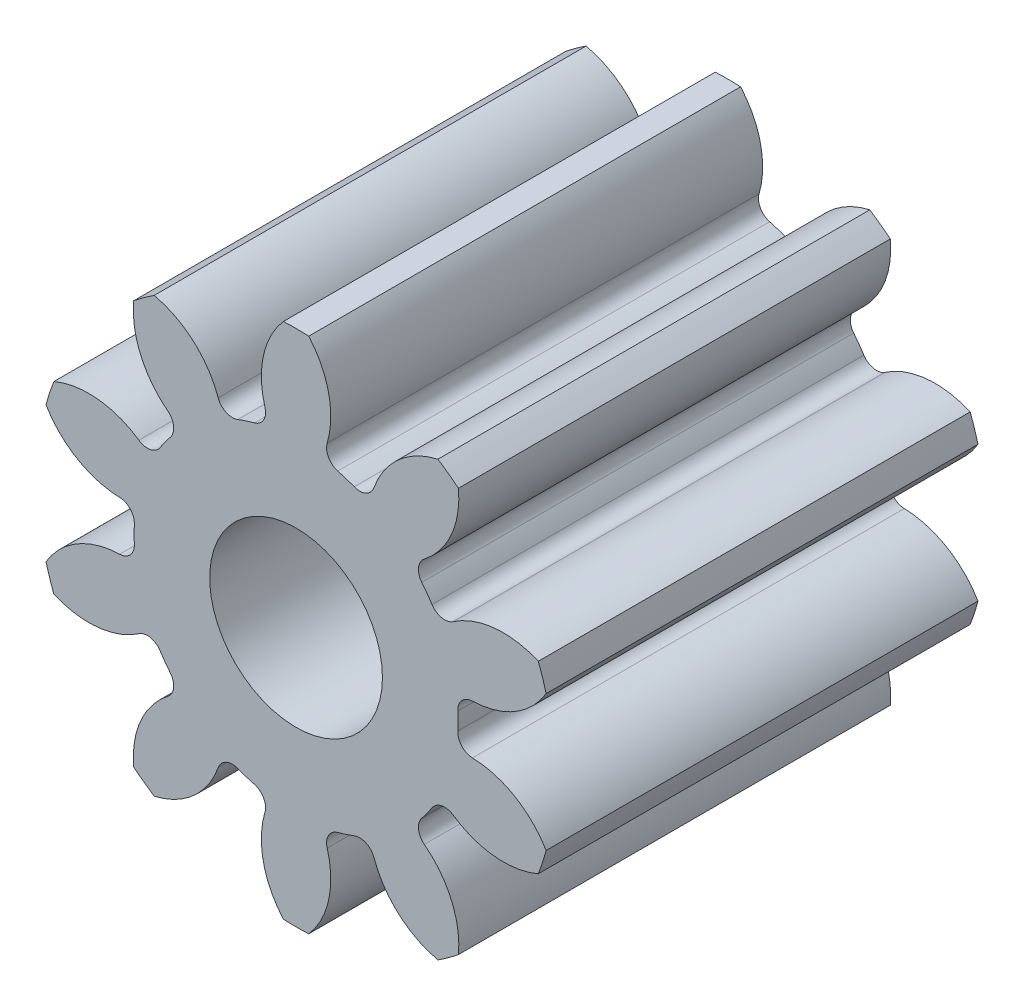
ISO-10303-21;
HEADER;
FILE_DESCRIPTION(('STEP AP214'),'2;1');
FILE_NAME('part.step','',(''),(''),'','','');
FILE_SCHEMA(('AUTOMOTIVE_DESIGN { 1 0 10303 214 1 1 1 1 }'));
ENDSEC;
DATA;
#1=APPLICATION_CONTEXT('core data for automotive mechanical design processes');
#2=APPLICATION_PROTOCOL_DEFINITION('international standard','automotive_design',2000,#1);
#3=PRODUCT_CONTEXT('',#1,'mechanical');
#4=PRODUCT('Part','Part','',(#3));
#5=PRODUCT_RELATED_PRODUCT_CATEGORY('part','',(#4));
#6=PRODUCT_DEFINITION_FORMATION('','',#4);
#7=PRODUCT_DEFINITION_CONTEXT('part definition',#1,'design');
#8=PRODUCT_DEFINITION('design','',#6,#7);
#9=PRODUCT_DEFINITION_SHAPE('','',#8);
#10=(LENGTH_UNIT() NAMED_UNIT(*) SI_UNIT(.MILLI.,.METRE.));
#11=(NAMED_UNIT(*) PLANE_ANGLE_UNIT() SI_UNIT($,.RADIAN.));
#12=(NAMED_UNIT(*) SI_UNIT($,.STERADIAN.) SOLID_ANGLE_UNIT());
#13=UNCERTAINTY_MEASURE_WITH_UNIT(LENGTH_MEASURE(1.E-05),#10,'distance_accuracy_value','');
#14=(GEOMETRIC_REPRESENTATION_CONTEXT(3) GLOBAL_UNCERTAINTY_ASSIGNED_CONTEXT((#13)) GLOBAL_UNIT_ASSIGNED_CONTEXT((#10,
#11,#12)) REPRESENTATION_CONTEXT('',''));
#15=CARTESIAN_POINT('',(0.,0.,0.));
#16=DIRECTION('',(0.,0.,1.));
#17=DIRECTION('',(1.,0.,0.));
#18=AXIS2_PLACEMENT_3D('',#15,#16,#17);
#19=CARTESIAN_POINT('',(-1.37870691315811,-0.560352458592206,5.));
#20=DIRECTION('',(0.,0.,1.));
#21=DIRECTION('',(1.,0.,0.));
#22=AXIS2_PLACEMENT_3D('',#19,#20,#21);
#23=PLANE('',#22);
#24=CARTESIAN_POINT('',(0.488647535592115,0.950220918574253,5.));
#25=DIRECTION('',(0.,0.,1.));
#26=DIRECTION('',(0.809016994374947,-0.587785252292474,0.));
#27=AXIS2_PLACEMENT_3D('',#24,#25,#26);
#28=CIRCLE('',#27,1.02488291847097);
#29=CARTESIAN_POINT('',(0.263714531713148,1.95011598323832,5.));
#30=VERTEX_POINT('',#29);
#31=CARTESIAN_POINT('',(-0.476887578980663,1.29391691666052,5.));
#32=VERTEX_POINT('',#31);
#33=EDGE_CURVE('E632',#30,#32,#28,.T.);
#34=ORIENTED_EDGE('',*,*,#33,.T.);
#35=CARTESIAN_POINT('',(-0.64175386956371,1.35260342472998,5.));
#36=DIRECTION('',(0.,0.,1.));
#37=DIRECTION('',(1.,0.,0.));
#38=AXIS2_PLACEMENT_3D('',#35,#36,#37);
#39=CIRCLE('',#38,0.175);
#40=CARTESIAN_POINT('',(-0.704664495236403,1.18930231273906,5.));
#41=VERTEX_POINT('',#40);
#42=EDGE_CURVE('E708',#32,#41,#39,.F.);
#43=ORIENTED_EDGE('',*,*,#42,.T.);
#44=CARTESIAN_POINT('',(-1.37870691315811,-0.560352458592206,5.));
#45=DIRECTION('',(0.,0.,1.));
#46=DIRECTION('',(1.,0.,0.));
#47=AXIS2_PLACEMENT_3D('',#44,#45,#46);
#48=CIRCLE('',#47,1.875);
#49=CARTESIAN_POINT('',(-0.895597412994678,1.25134017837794,5.));
#50=VERTEX_POINT('',#49);
#51=EDGE_CURVE('E652',#41,#50,#48,.T.);
#52=ORIENTED_EDGE('',*,*,#51,.T.);
#53=CARTESIAN_POINT('',(-0.850507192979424,1.42043149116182,5.));
#54=DIRECTION('',(0.,0.,1.));
#55=DIRECTION('',(1.,0.,0.));
#56=AXIS2_PLACEMENT_3D('',#53,#54,#55);
#57=CIRCLE('',#56,0.175);
#58=CARTESIAN_POINT('',(-1.01838188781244,1.46985908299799,5.));
#59=VERTEX_POINT('',#58);
#60=EDGE_CURVE('E683',#50,#59,#57,.F.);
#61=ORIENTED_EDGE('',*,*,#60,.T.);
#62=CARTESIAN_POINT('',(-2.00153564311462,1.75933048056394,5.));
#63=DIRECTION('',(0.,0.,-1.));
#64=DIRECTION('',(-1.,0.,0.));
#65=AXIS2_PLACEMENT_3D('',#62,#63,#64);
#66=CIRCLE('',#65,1.02488291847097);
#67=CARTESIAN_POINT('',(-1.23183744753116,2.43605027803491,5.));
#68=VERTEX_POINT('',#67);
#69=EDGE_CURVE('E654',#68,#59,#66,.T.);
#70=ORIENTED_EDGE('',*,*,#69,.F.);
#71=CARTESIAN_POINT('',(-1.37870691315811,-0.560352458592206,5.));
#72=DIRECTION('',(0.,0.,1.));
#73=DIRECTION('',(1.,0.,0.));
#74=AXIS2_PLACEMENT_3D('',#71,#72,#73);
#75=CIRCLE('',#74,3.);
#76=CARTESIAN_POINT('',(-1.52557637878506,2.43605027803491,5.));
#77=VERTEX_POINT('',#76);
#78=EDGE_CURVE('E657',#68,#77,#75,.T.);
#79=ORIENTED_EDGE('',*,*,#78,.T.);
#80=CARTESIAN_POINT('',(-0.755878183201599,1.75933048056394,5.));
#81=DIRECTION('',(0.,0.,1.));
#82=DIRECTION('',(1.,0.,0.));
#83=AXIS2_PLACEMENT_3D('',#80,#81,#82);
#84=CIRCLE('',#83,1.02488291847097);
#85=CARTESIAN_POINT('',(-1.73903193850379,1.46985908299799,5.));
#86=VERTEX_POINT('',#85);
#87=EDGE_CURVE('E659',#77,#86,#84,.T.);
#88=ORIENTED_EDGE('',*,*,#87,.T.);
#89=CARTESIAN_POINT('',(-1.9069066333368,1.42043149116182,5.));
#90=DIRECTION('',(0.,0.,1.));
#91=DIRECTION('',(1.,0.,0.));
#92=AXIS2_PLACEMENT_3D('',#89,#90,#91);
#93=CIRCLE('',#92,0.175);
#94=CARTESIAN_POINT('',(-1.86181641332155,1.25134017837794,5.));
#95=VERTEX_POINT('',#94);
#96=EDGE_CURVE('E687',#86,#95,#93,.F.);
#97=ORIENTED_EDGE('',*,*,#96,.T.);
#98=CARTESIAN_POINT('',(-1.37870691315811,-0.560352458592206,5.));
#99=DIRECTION('',(0.,0.,-1.));
#100=DIRECTION('',(-1.,0.,0.));
#101=AXIS2_PLACEMENT_3D('',#98,#99,#100);
#102=CIRCLE('',#101,1.875);
#103=CARTESIAN_POINT('',(-2.0527493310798,1.18930231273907,5.));
#104=VERTEX_POINT('',#103);
#105=EDGE_CURVE('E662',#104,#95,#102,.T.);
#106=ORIENTED_EDGE('',*,*,#105,.F.);
#107=CARTESIAN_POINT('',(-2.11565995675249,1.35260342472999,5.));
#108=DIRECTION('',(0.,0.,1.));
#109=DIRECTION('',(1.,0.,0.));
#110=AXIS2_PLACEMENT_3D('',#107,#108,#109);
#111=CIRCLE('',#110,0.175);
#112=CARTESIAN_POINT('',(-2.28052624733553,1.29391691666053,5.));
#113=VERTEX_POINT('',#112);
#114=EDGE_CURVE('E859',#104,#113,#111,.F.);
#115=ORIENTED_EDGE('',*,*,#114,.T.);
#116=CARTESIAN_POINT('',(-3.24606136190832,0.950220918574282,5.));
#117=DIRECTION('',(0.,0.,-1.));
#118=DIRECTION('',(-0.809016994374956,-0.587785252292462,0.));
#119=AXIS2_PLACEMENT_3D('',#116,#117,#118);
#120=CIRCLE('',#119,1.02488291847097);
#121=CARTESIAN_POINT('',(-3.02112835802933,1.95011598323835,5.));
#122=VERTEX_POINT('',#121);
#123=EDGE_CURVE('E435',#122,#113,#120,.T.);
#124=ORIENTED_EDGE('',*,*,#123,.F.);
#125=CARTESIAN_POINT('',(-1.37870691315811,-0.560352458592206,5.));
#126=DIRECTION('',(0.,0.,1.));
#127=DIRECTION('',(0.809016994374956,0.587785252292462,0.));
#128=AXIS2_PLACEMENT_3D('',#125,#126,#127);
#129=CIRCLE('',#128,3.);
#130=CARTESIAN_POINT('',(-3.25876814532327,1.77746057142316,5.));
#131=VERTEX_POINT('',#130);
#132=EDGE_CURVE('E408',#122,#131,#129,.T.);
#133=ORIENTED_EDGE('',*,*,#132,.T.);
#134=CARTESIAN_POINT('',(-2.23830330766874,1.68240000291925,5.));
#135=DIRECTION('',(0.,0.,1.));
#136=DIRECTION('',(0.809016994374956,0.587785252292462,0.));
#137=AXIS2_PLACEMENT_3D('',#134,#135,#136);
#138=CIRCLE('',#137,1.02488291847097);
#139=CARTESIAN_POINT('',(-2.86354438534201,0.87032944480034,5.));
#140=VERTEX_POINT('',#139);
#141=EDGE_CURVE('E438',#131,#140,#138,.T.);
#142=ORIENTED_EDGE('',*,*,#141,.T.);
#143=CARTESIAN_POINT('',(-2.9703050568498,0.73166741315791,5.));
#144=DIRECTION('',(0.,0.,1.));
#145=DIRECTION('',(1.,0.,0.));
#146=AXIS2_PLACEMENT_3D('',#143,#144,#145);
#147=CIRCLE('',#146,0.175);
#148=CARTESIAN_POINT('',(-2.83443692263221,0.621373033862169,5.));
#149=VERTEX_POINT('',#148);
#150=EDGE_CURVE('E11',#140,#149,#147,.F.);
#151=ORIENTED_EDGE('',*,*,#150,.T.);
#152=CARTESIAN_POINT('',(-1.37870691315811,-0.560352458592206,5.));
#153=DIRECTION('',(0.,0.,1.));
#154=DIRECTION('',(0.309016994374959,0.95105651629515,0.));
#155=AXIS2_PLACEMENT_3D('',#152,#153,#154);
#156=CIRCLE('',#155,1.875);
#157=CARTESIAN_POINT('',(-2.95243995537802,0.458955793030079,5.));
#158=VERTEX_POINT('',#157);
#159=EDGE_CURVE('E450',#149,#158,#156,.T.);
#160=ORIENTED_EDGE('',*,*,#159,.T.);
#161=CARTESIAN_POINT('',(-3.09932170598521,0.554091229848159,5.));
#162=DIRECTION('',(0.,0.,1.));
#163=DIRECTION('',(1.,0.,0.));
#164=AXIS2_PLACEMENT_3D('',#161,#162,#163);
#165=CIRCLE('',#164,0.175);
#166=CARTESIAN_POINT('',(-3.19820627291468,0.409706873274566,5.));
#167=VERTEX_POINT('',#166);
#168=EDGE_CURVE('E844',#158,#167,#165,.F.);
#169=ORIENTED_EDGE('',*,*,#168,.T.);
#170=CARTESIAN_POINT('',(-3.77732115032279,-0.435876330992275,5.));
#171=DIRECTION('',(0.,0.,-1.));
#172=DIRECTION('',(-0.309016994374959,-0.95105651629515,0.));
#173=AXIS2_PLACEMENT_3D('',#170,#171,#172);
#174=CIRCLE('',#173,1.02488291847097);
#175=CARTESIAN_POINT('',(-4.18307010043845,0.505268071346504,5.));
#176=VERTEX_POINT('',#175);
#177=EDGE_CURVE('E452',#176,#167,#174,.T.);
#178=ORIENTED_EDGE('',*,*,#177,.F.);
#179=CARTESIAN_POINT('',(-1.37870691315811,-0.560352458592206,5.));
#180=DIRECTION('',(0.,0.,1.));
#181=DIRECTION('',(0.309016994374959,0.95105651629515,0.));
#182=AXIS2_PLACEMENT_3D('',#179,#180,#181);
#183=CIRCLE('',#182,3.);
#184=CARTESIAN_POINT('',(-4.27384042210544,0.22590574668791,5.));
#185=VERTEX_POINT('',#184);
#186=EDGE_CURVE('E455',#176,#185,#183,.T.);
#187=ORIENTED_EDGE('',*,*,#186,.T.);
#188=CARTESIAN_POINT('',(-3.39239182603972,0.748814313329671,5.));
#189=DIRECTION('',(0.,0.,1.));
#190=DIRECTION('',(0.309016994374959,0.95105651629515,0.));
#191=AXIS2_PLACEMENT_3D('',#188,#189,#190);
#192=CIRCLE('',#191,1.02488291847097);
#193=CARTESIAN_POINT('',(-3.42089938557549,-0.275672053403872,5.));
#194=VERTEX_POINT('',#193);
#195=EDGE_CURVE('E457',#185,#194,#192,.T.);
#196=ORIENTED_EDGE('',*,*,#195,.T.);
#197=CARTESIAN_POINT('',(-3.42576708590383,-0.450604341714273,5.));
#198=DIRECTION('',(0.,0.,1.));
#199=DIRECTION('',(1.,0.,0.));
#200=AXIS2_PLACEMENT_3D('',#197,#198,#199);
#201=CIRCLE('',#200,0.175);
#202=CARTESIAN_POINT('',(-3.251018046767,-0.459973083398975,5.));
#203=VERTEX_POINT('',#202);
#204=EDGE_CURVE('E848',#194,#203,#201,.F.);
#205=ORIENTED_EDGE('',*,*,#204,.T.);
#206=CARTESIAN_POINT('',(-1.37870691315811,-0.560352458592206,5.));
#207=DIRECTION('',(0.,0.,1.));
#208=DIRECTION('',(-0.309016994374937,0.951056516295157,0.));
#209=AXIS2_PLACEMENT_3D('',#206,#207,#208);
#210=CIRCLE('',#209,1.875);
#211=CARTESIAN_POINT('',(-3.25101804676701,-0.660731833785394,5.));
#212=VERTEX_POINT('',#211);
#213=EDGE_CURVE('E475',#203,#212,#210,.T.);
#214=ORIENTED_EDGE('',*,*,#213,.T.);
#215=CARTESIAN_POINT('',(-3.42576708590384,-0.670100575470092,5.));
#216=DIRECTION('',(0.,0.,1.));
#217=DIRECTION('',(1.,0.,0.));
#218=AXIS2_PLACEMENT_3D('',#215,#216,#217);
#219=CIRCLE('',#218,0.175);
#220=CARTESIAN_POINT('',(-3.42089938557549,-0.845032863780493,5.));
#221=VERTEX_POINT('',#220);
#222=EDGE_CURVE('E824',#212,#221,#219,.F.);
#223=ORIENTED_EDGE('',*,*,#222,.T.);
#224=CARTESIAN_POINT('',(-3.39239182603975,-1.86951923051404,5.));
#225=DIRECTION('',(0.,0.,-1.));
#226=DIRECTION('',(0.309016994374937,-0.951056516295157,0.));
#227=AXIS2_PLACEMENT_3D('',#224,#225,#226);
#228=CIRCLE('',#227,1.02488291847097);
#229=CARTESIAN_POINT('',(-4.27384042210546,-1.34661066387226,5.));
#230=VERTEX_POINT('',#229);
#231=EDGE_CURVE('E477',#230,#221,#228,.T.);
#232=ORIENTED_EDGE('',*,*,#231,.F.);
#233=CARTESIAN_POINT('',(-1.37870691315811,-0.560352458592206,5.));
#234=DIRECTION('',(0.,0.,1.));
#235=DIRECTION('',(-0.309016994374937,0.951056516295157,0.));
#236=AXIS2_PLACEMENT_3D('',#233,#234,#235);
#237=CIRCLE('',#236,3.);
#238=CARTESIAN_POINT('',(-4.18307010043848,-1.62597298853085,5.));
#239=VERTEX_POINT('',#238);
#240=EDGE_CURVE('E480',#230,#239,#237,.T.);
#241=ORIENTED_EDGE('',*,*,#240,.T.);
#242=CARTESIAN_POINT('',(-3.77732115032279,-0.684828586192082,5.));
#243=DIRECTION('',(0.,0.,1.));
#244=DIRECTION('',(-0.309016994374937,0.951056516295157,0.));
#245=AXIS2_PLACEMENT_3D('',#242,#243,#244);
#246=CIRCLE('',#245,1.02488291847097);
#247=CARTESIAN_POINT('',(-3.19820627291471,-1.53041179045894,5.));
#248=VERTEX_POINT('',#247);
#249=EDGE_CURVE('E482',#239,#248,#246,.T.);
#250=ORIENTED_EDGE('',*,*,#249,.T.);
#251=CARTESIAN_POINT('',(-3.09932170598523,-1.67479614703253,5.));
#252=DIRECTION('',(0.,0.,1.));
#253=DIRECTION('',(1.,0.,0.));
#254=AXIS2_PLACEMENT_3D('',#251,#252,#253);
#255=CIRCLE('',#254,0.175);
#256=CARTESIAN_POINT('',(-2.95243995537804,-1.57966071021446,5.));
#257=VERTEX_POINT('',#256);
#258=EDGE_CURVE('E828',#248,#257,#255,.F.);
#259=ORIENTED_EDGE('',*,*,#258,.T.);
#260=CARTESIAN_POINT('',(-1.37870691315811,-0.560352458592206,5.));
#261=DIRECTION('',(0.,0.,1.));
#262=DIRECTION('',(-0.809016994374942,0.587785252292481,0.));
#263=AXIS2_PLACEMENT_3D('',#260,#261,#262);
#264=CIRCLE('',#263,1.875);
#265=CARTESIAN_POINT('',(-2.83443692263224,-1.74207795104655,5.));
#266=VERTEX_POINT('',#265);
#267=EDGE_CURVE('E500',#257,#266,#264,.T.);
#268=ORIENTED_EDGE('',*,*,#267,.T.);
#269=CARTESIAN_POINT('',(-2.97030505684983,-1.85237233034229,5.));
#270=DIRECTION('',(0.,0.,1.));
#271=DIRECTION('',(1.,0.,0.));
#272=AXIS2_PLACEMENT_3D('',#269,#270,#271);
#273=CIRCLE('',#272,0.175);
#274=CARTESIAN_POINT('',(-2.86354438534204,-1.99103436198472,5.));
#275=VERTEX_POINT('',#274);
#276=EDGE_CURVE('E804',#266,#275,#273,.F.);
#277=ORIENTED_EDGE('',*,*,#276,.T.);
#278=CARTESIAN_POINT('',(-2.23830330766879,-2.80310492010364,5.));
#279=DIRECTION('',(0.,0.,-1.));
#280=DIRECTION('',(0.809016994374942,-0.587785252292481,0.));
#281=AXIS2_PLACEMENT_3D('',#278,#279,#280);
#282=CIRCLE('',#281,1.02488291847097);
#283=CARTESIAN_POINT('',(-3.25876814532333,-2.89816548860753,5.));
#284=VERTEX_POINT('',#283);
#285=EDGE_CURVE('E502',#284,#275,#282,.T.);
#286=ORIENTED_EDGE('',*,*,#285,.F.);
#287=CARTESIAN_POINT('',(-1.37870691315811,-0.560352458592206,5.));
#288=DIRECTION('',(0.,0.,1.));
#289=DIRECTION('',(-0.809016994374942,0.587785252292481,0.));
#290=AXIS2_PLACEMENT_3D('',#287,#288,#289);
#291=CIRCLE('',#290,3.);
#292=CARTESIAN_POINT('',(-3.02112835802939,-3.07082090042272,5.));
#293=VERTEX_POINT('',#292);
#294=EDGE_CURVE('E505',#284,#293,#291,.T.);
#295=ORIENTED_EDGE('',*,*,#294,.T.);
#296=CARTESIAN_POINT('',(-3.24606136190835,-2.07092583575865,5.));
#297=DIRECTION('',(0.,0.,1.));
#298=DIRECTION('',(-0.809016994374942,0.587785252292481,0.));
#299=AXIS2_PLACEMENT_3D('',#296,#297,#298);
#300=CIRCLE('',#299,1.02488291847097);
#301=CARTESIAN_POINT('',(-2.28052624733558,-2.41462183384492,5.));
#302=VERTEX_POINT('',#301);
#303=EDGE_CURVE('E507',#293,#302,#300,.T.);
#304=ORIENTED_EDGE('',*,*,#303,.T.);
#305=CARTESIAN_POINT('',(-2.11565995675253,-2.47330834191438,5.));
#306=DIRECTION('',(0.,0.,1.));
#307=DIRECTION('',(1.,0.,0.));
#308=AXIS2_PLACEMENT_3D('',#305,#306,#307);
#309=CIRCLE('',#308,0.175);
#310=CARTESIAN_POINT('',(-2.05274933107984,-2.31000722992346,5.));
#311=VERTEX_POINT('',#310);
#312=EDGE_CURVE('E808',#302,#311,#309,.F.);
#313=ORIENTED_EDGE('',*,*,#312,.T.);
#314=CARTESIAN_POINT('',(-1.37870691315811,-0.560352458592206,5.));
#315=DIRECTION('',(0.,0.,1.));
#316=DIRECTION('',(-1.,0.,0.));
#317=AXIS2_PLACEMENT_3D('',#314,#315,#316);
#318=CIRCLE('',#317,1.875);
#319=CARTESIAN_POINT('',(-1.86181641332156,-2.37204509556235,5.));
#320=VERTEX_POINT('',#319);
#321=EDGE_CURVE('E525',#311,#320,#318,.T.);
#322=ORIENTED_EDGE('',*,*,#321,.T.);
#323=CARTESIAN_POINT('',(-1.90690663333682,-2.54113640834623,5.));
#324=DIRECTION('',(0.,0.,1.));
#325=DIRECTION('',(1.,0.,0.));
#326=AXIS2_PLACEMENT_3D('',#323,#324,#325);
#327=CIRCLE('',#326,0.175);
#328=CARTESIAN_POINT('',(-1.7390319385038,-2.59056400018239,5.));
#329=VERTEX_POINT('',#328);
#330=EDGE_CURVE('E784',#320,#329,#327,.F.);
#331=ORIENTED_EDGE('',*,*,#330,.T.);
#332=CARTESIAN_POINT('',(-0.755878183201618,-2.88003539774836,5.));
#333=DIRECTION('',(0.,0.,-1.));
#334=DIRECTION('',(1.,0.,0.));
#335=AXIS2_PLACEMENT_3D('',#332,#333,#334);
#336=CIRCLE('',#335,1.02488291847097);
#337=CARTESIAN_POINT('',(-1.52557637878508,-3.55675519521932,5.));
#338=VERTEX_POINT('',#337);
#339=EDGE_CURVE('E527',#338,#329,#336,.T.);
#340=ORIENTED_EDGE('',*,*,#339,.F.);
#341=CARTESIAN_POINT('',(-1.37870691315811,-0.560352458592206,5.));
#342=DIRECTION('',(0.,0.,1.));
#343=DIRECTION('',(-1.,0.,0.));
#344=AXIS2_PLACEMENT_3D('',#341,#342,#343);
#345=CIRCLE('',#344,3.);
#346=CARTESIAN_POINT('',(-1.23183744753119,-3.55675519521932,5.));
#347=VERTEX_POINT('',#346);
#348=EDGE_CURVE('E530',#338,#347,#345,.T.);
#349=ORIENTED_EDGE('',*,*,#348,.T.);
#350=CARTESIAN_POINT('',(-2.00153564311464,-2.88003539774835,5.));
#351=DIRECTION('',(0.,0.,1.));
#352=DIRECTION('',(-1.,0.,0.));
#353=AXIS2_PLACEMENT_3D('',#350,#351,#352);
#354=CIRCLE('',#353,1.02488291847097);
#355=CARTESIAN_POINT('',(-1.01838188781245,-2.5905640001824,5.));
#356=VERTEX_POINT('',#355);
#357=EDGE_CURVE('E532',#347,#356,#354,.T.);
#358=ORIENTED_EDGE('',*,*,#357,.T.);
#359=CARTESIAN_POINT('',(-0.850507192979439,-2.54113640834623,5.));
#360=DIRECTION('',(0.,0.,1.));
#361=DIRECTION('',(1.,0.,0.));
#362=AXIS2_PLACEMENT_3D('',#359,#360,#361);
#363=CIRCLE('',#362,0.175);
#364=CARTESIAN_POINT('',(-0.895597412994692,-2.37204509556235,5.));
#365=VERTEX_POINT('',#364);
#366=EDGE_CURVE('E788',#356,#365,#363,.F.);
#367=ORIENTED_EDGE('',*,*,#366,.T.);
#368=CARTESIAN_POINT('',(-1.37870691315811,-0.560352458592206,5.));
#369=DIRECTION('',(0.,0.,1.));
#370=DIRECTION('',(-0.809016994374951,-0.587785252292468,0.));
#371=AXIS2_PLACEMENT_3D('',#368,#369,#370);
#372=CIRCLE('',#371,1.875);
#373=CARTESIAN_POINT('',(-0.704664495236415,-2.31000722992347,5.));
#374=VERTEX_POINT('',#373);
#375=EDGE_CURVE('E550',#365,#374,#372,.T.);
#376=ORIENTED_EDGE('',*,*,#375,.T.);
#377=CARTESIAN_POINT('',(-0.641753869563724,-2.47330834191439,5.));
#378=DIRECTION('',(0.,0.,1.));
#379=DIRECTION('',(1.,0.,0.));
#380=AXIS2_PLACEMENT_3D('',#377,#378,#379);
#381=CIRCLE('',#380,0.175);
#382=CARTESIAN_POINT('',(-0.476887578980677,-2.41462183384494,5.));
#383=VERTEX_POINT('',#382);
#384=EDGE_CURVE('E764',#374,#383,#381,.F.);
#385=ORIENTED_EDGE('',*,*,#384,.T.);
#386=CARTESIAN_POINT('',(0.488647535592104,-2.07092583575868,5.));
#387=DIRECTION('',(0.,0.,-1.));
#388=DIRECTION('',(0.809016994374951,0.587785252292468,0.));
#389=AXIS2_PLACEMENT_3D('',#386,#387,#388);
#390=CIRCLE('',#389,1.02488291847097);
#391=CARTESIAN_POINT('',(0.263714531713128,-3.07082090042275,5.));
#392=VERTEX_POINT('',#391);
#393=EDGE_CURVE('E552',#392,#383,#390,.T.);
#394=ORIENTED_EDGE('',*,*,#393,.F.);
#395=CARTESIAN_POINT('',(-1.37870691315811,-0.560352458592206,5.));
#396=DIRECTION('',(0.,0.,1.));
#397=DIRECTION('',(-0.809016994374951,-0.587785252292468,0.));
#398=AXIS2_PLACEMENT_3D('',#395,#396,#397);
#399=CIRCLE('',#398,3.);
#400=CARTESIAN_POINT('',(0.501354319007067,-2.89816548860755,5.));
#401=VERTEX_POINT('',#400);
#402=EDGE_CURVE('E555',#392,#401,#399,.T.);
#403=ORIENTED_EDGE('',*,*,#402,.T.);
#404=CARTESIAN_POINT('',(-0.519110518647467,-2.80310492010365,5.));
#405=DIRECTION('',(0.,0.,1.));
#406=DIRECTION('',(-0.809016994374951,-0.587785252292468,0.));
#407=AXIS2_PLACEMENT_3D('',#404,#405,#406);
#408=CIRCLE('',#407,1.02488291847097);
#409=CARTESIAN_POINT('',(0.106130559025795,-1.99103436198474,5.));
#410=VERTEX_POINT('',#409);
#411=EDGE_CURVE('E557',#401,#410,#408,.T.);
#412=ORIENTED_EDGE('',*,*,#411,.T.);
#413=CARTESIAN_POINT('',(0.212891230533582,-1.85237233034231,5.));
#414=DIRECTION('',(0.,0.,1.));
#415=DIRECTION('',(1.,0.,0.));
#416=AXIS2_PLACEMENT_3D('',#413,#414,#415);
#417=CIRCLE('',#416,0.175);
#418=CARTESIAN_POINT('',(0.077023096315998,-1.74207795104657,5.));
#419=VERTEX_POINT('',#418);
#420=EDGE_CURVE('E768',#410,#419,#417,.F.);
#421=ORIENTED_EDGE('',*,*,#420,.T.);
#422=CARTESIAN_POINT('',(-1.37870691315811,-0.560352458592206,5.));
#423=DIRECTION('',(0.,0.,1.));
#424=DIRECTION('',(-0.309016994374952,-0.951056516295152,0.));
#425=AXIS2_PLACEMENT_3D('',#422,#423,#424);
#426=CIRCLE('',#425,1.875);
#427=CARTESIAN_POINT('',(0.195026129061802,-1.57966071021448,5.));
#428=VERTEX_POINT('',#427);
#429=EDGE_CURVE('E575',#419,#428,#426,.T.);
#430=ORIENTED_EDGE('',*,*,#429,.T.);
#431=CARTESIAN_POINT('',(0.341907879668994,-1.67479614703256,5.));
#432=DIRECTION('',(0.,0.,1.));
#433=DIRECTION('',(1.,0.,0.));
#434=AXIS2_PLACEMENT_3D('',#431,#432,#433);
#435=CIRCLE('',#434,0.175);
#436=CARTESIAN_POINT('',(0.440792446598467,-1.53041179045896,5.));
#437=VERTEX_POINT('',#436);
#438=EDGE_CURVE('E744',#428,#437,#435,.F.);
#439=ORIENTED_EDGE('',*,*,#438,.T.);
#440=CARTESIAN_POINT('',(1.01990732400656,-0.684828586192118,5.));
#441=DIRECTION('',(0.,0.,-1.));
#442=DIRECTION('',(0.309016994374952,0.951056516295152,0.));
#443=AXIS2_PLACEMENT_3D('',#440,#441,#442);
#444=CIRCLE('',#443,1.02488291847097);
#445=CARTESIAN_POINT('',(1.42565627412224,-1.62597298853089,5.));
#446=VERTEX_POINT('',#445);
#447=EDGE_CURVE('E577',#446,#437,#444,.T.);
#448=ORIENTED_EDGE('',*,*,#447,.F.);
#449=CARTESIAN_POINT('',(-1.37870691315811,-0.560352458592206,5.));
#450=DIRECTION('',(0.,0.,1.));
#451=DIRECTION('',(-0.309016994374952,-0.951056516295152,0.));
#452=AXIS2_PLACEMENT_3D('',#449,#450,#451);
#453=CIRCLE('',#452,3.);
#454=CARTESIAN_POINT('',(1.51642659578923,-1.3466106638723,5.));
#455=VERTEX_POINT('',#454);
#456=EDGE_CURVE('E580',#446,#455,#453,.T.);
#457=ORIENTED_EDGE('',*,*,#456,.T.);
#458=CARTESIAN_POINT('',(0.634977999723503,-1.86951923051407,5.));
#459=DIRECTION('',(0.,0.,1.));
#460=DIRECTION('',(-0.309016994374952,-0.951056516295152,0.));
#461=AXIS2_PLACEMENT_3D('',#458,#459,#460);
#462=CIRCLE('',#461,1.02488291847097);
#463=CARTESIAN_POINT('',(0.663485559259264,-0.845032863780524,5.));
#464=VERTEX_POINT('',#463);
#465=EDGE_CURVE('E582',#455,#464,#462,.T.);
#466=ORIENTED_EDGE('',*,*,#465,.T.);
#467=CARTESIAN_POINT('',(0.668353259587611,-0.670100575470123,5.));
#468=DIRECTION('',(0.,0.,1.));
#469=DIRECTION('',(1.,0.,0.));
#470=AXIS2_PLACEMENT_3D('',#467,#468,#469);
#471=CIRCLE('',#470,0.175);
#472=CARTESIAN_POINT('',(0.493604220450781,-0.660731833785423,5.));
#473=VERTEX_POINT('',#472);
#474=EDGE_CURVE('E748',#464,#473,#471,.F.);
#475=ORIENTED_EDGE('',*,*,#474,.T.);
#476=CARTESIAN_POINT('',(-1.37870691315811,-0.560352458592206,5.));
#477=DIRECTION('',(0.,0.,1.));
#478=DIRECTION('',(0.309016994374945,-0.951056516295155,0.));
#479=AXIS2_PLACEMENT_3D('',#476,#477,#478);
#480=CIRCLE('',#479,1.875);
#481=CARTESIAN_POINT('',(0.493604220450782,-0.459973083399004,5.));
#482=VERTEX_POINT('',#481);
#483=EDGE_CURVE('E600',#473,#482,#480,.T.);
#484=ORIENTED_EDGE('',*,*,#483,.T.);
#485=CARTESIAN_POINT('',(0.668353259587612,-0.450604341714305,5.));
#486=DIRECTION('',(0.,0.,1.));
#487=DIRECTION('',(1.,0.,0.));
#488=AXIS2_PLACEMENT_3D('',#485,#486,#487);
#489=CIRCLE('',#488,0.175);
#490=CARTESIAN_POINT('',(0.663485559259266,-0.275672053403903,5.));
#491=VERTEX_POINT('',#490);
#492=EDGE_CURVE('E724',#482,#491,#489,.F.);
#493=ORIENTED_EDGE('',*,*,#492,.T.);
#494=CARTESIAN_POINT('',(0.634977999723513,0.74881431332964,5.));
#495=DIRECTION('',(0.,0.,-1.));
#496=DIRECTION('',(-0.309016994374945,0.951056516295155,0.));
#497=AXIS2_PLACEMENT_3D('',#494,#495,#496);
#498=CIRCLE('',#497,1.02488291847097);
#499=CARTESIAN_POINT('',(1.51642659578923,0.225905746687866,5.));
#500=VERTEX_POINT('',#499);
#501=EDGE_CURVE('E602',#500,#491,#498,.T.);
#502=ORIENTED_EDGE('',*,*,#501,.F.);
#503=CARTESIAN_POINT('',(-1.37870691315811,-0.560352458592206,5.));
#504=DIRECTION('',(0.,0.,1.));
#505=DIRECTION('',(0.309016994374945,-0.951056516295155,0.));
#506=AXIS2_PLACEMENT_3D('',#503,#504,#505);
#507=CIRCLE('',#506,3.);
#508=CARTESIAN_POINT('',(1.42565627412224,0.50526807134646,5.));
#509=VERTEX_POINT('',#508);
#510=EDGE_CURVE('E605',#500,#509,#507,.T.);
#511=ORIENTED_EDGE('',*,*,#510,.T.);
#512=CARTESIAN_POINT('',(1.01990732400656,-0.435876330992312,5.));
#513=DIRECTION('',(0.,0.,1.));
#514=DIRECTION('',(0.309016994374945,-0.951056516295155,0.));
#515=AXIS2_PLACEMENT_3D('',#512,#513,#514);
#516=CIRCLE('',#515,1.02488291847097);
#517=CARTESIAN_POINT('',(0.440792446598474,0.409706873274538,5.));
#518=VERTEX_POINT('',#517);
#519=EDGE_CURVE('E607',#509,#518,#516,.T.);
#520=ORIENTED_EDGE('',*,*,#519,.T.);
#521=CARTESIAN_POINT('',(0.341907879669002,0.554091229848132,5.));
#522=DIRECTION('',(0.,0.,1.));
#523=DIRECTION('',(1.,0.,0.));
#524=AXIS2_PLACEMENT_3D('',#521,#522,#523);
#525=CIRCLE('',#524,0.175);
#526=CARTESIAN_POINT('',(0.19502612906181,0.458955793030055,5.));
#527=VERTEX_POINT('',#526);
#528=EDGE_CURVE('E728',#518,#527,#525,.F.);
#529=ORIENTED_EDGE('',*,*,#528,.T.);
#530=CARTESIAN_POINT('',(-1.37870691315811,-0.560352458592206,5.));
#531=DIRECTION('',(0.,0.,1.));
#532=DIRECTION('',(0.809016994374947,-0.587785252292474,0.));
#533=AXIS2_PLACEMENT_3D('',#530,#531,#532);
#534=CIRCLE('',#533,1.875);
#535=CARTESIAN_POINT('',(0.0770230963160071,0.621373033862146,5.));
#536=VERTEX_POINT('',#535);
#537=EDGE_CURVE('E625',#527,#536,#534,.T.);
#538=ORIENTED_EDGE('',*,*,#537,.T.);
#539=CARTESIAN_POINT('',(0.212891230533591,0.731667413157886,5.));
#540=DIRECTION('',(0.,0.,1.));
#541=DIRECTION('',(1.,0.,0.));
#542=AXIS2_PLACEMENT_3D('',#539,#540,#541);
#543=CIRCLE('',#542,0.175);
#544=CARTESIAN_POINT('',(0.106130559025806,0.870329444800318,5.));
#545=VERTEX_POINT('',#544);
#546=EDGE_CURVE('E704',#536,#545,#543,.F.);
#547=ORIENTED_EDGE('',*,*,#546,.T.);
#548=CARTESIAN_POINT('',(-0.51911051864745,1.68240000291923,5.));
#549=DIRECTION('',(0.,0.,-1.));
#550=DIRECTION('',(-0.809016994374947,0.587785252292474,0.));
#551=AXIS2_PLACEMENT_3D('',#548,#549,#550);
#552=CIRCLE('',#551,1.02488291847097);
#553=CARTESIAN_POINT('',(0.501354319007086,1.77746057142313,5.));
#554=VERTEX_POINT('',#553);
#555=EDGE_CURVE('E627',#554,#545,#552,.T.);
#556=ORIENTED_EDGE('',*,*,#555,.F.);
#557=CARTESIAN_POINT('',(-1.37870691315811,-0.560352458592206,5.));
#558=DIRECTION('',(0.,0.,1.));
#559=DIRECTION('',(0.809016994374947,-0.587785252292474,0.));
#560=AXIS2_PLACEMENT_3D('',#557,#558,#559);
#561=CIRCLE('',#560,3.);
#562=EDGE_CURVE('E630',#554,#30,#561,.T.);
#563=ORIENTED_EDGE('',*,*,#562,.T.);
#564=EDGE_LOOP('',(#34,#43,#52,#61,#70,#79,#88,#97,#106,#115,#124,#133,#142,#151,#160,#169,#178,
#187,#196,#205,#214,#223,#232,#241,#250,#259,#268,#277,#286,#295,#304,#313,#322,#331,#340,#349,
#358,#367,#376,#385,#394,#403,#412,#421,#430,#439,#448,#457,#466,#475,#484,#493,#502,#511,#520,
#529,#538,#547,#556,#563));
#565=FACE_BOUND('',#564,.T.);
#566=CARTESIAN_POINT('',(-1.37870691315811,-0.560352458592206,5.));
#567=DIRECTION('',(0.,0.,1.));
#568=DIRECTION('',(1.,0.,0.));
#569=AXIS2_PLACEMENT_3D('',#566,#567,#568);
#570=CIRCLE('',#569,1.);
#571=CARTESIAN_POINT('',(-0.378706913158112,-0.560352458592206,5.));
#572=VERTEX_POINT('',#571);
#573=EDGE_CURVE('E427',#572,#572,#570,.T.);
#574=ORIENTED_EDGE('',*,*,#573,.F.);
#575=EDGE_LOOP('',(#574));
#576=FACE_BOUND('',#575,.T.);
#577=ADVANCED_FACE('F26',(#565,#576),#23,.T.);
#578=CARTESIAN_POINT('',(-1.37870691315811,-0.560352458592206,0.));
#579=DIRECTION('',(0.,0.,1.));
#580=DIRECTION('',(1.,0.,0.));
#581=AXIS2_PLACEMENT_3D('',#578,#579,#580);
#582=PLANE('',#581);
#583=CARTESIAN_POINT('',(-1.37870691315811,-0.560352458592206,0.));
#584=DIRECTION('',(0.,0.,1.));
#585=DIRECTION('',(1.,0.,0.));
#586=AXIS2_PLACEMENT_3D('',#583,#584,#585);
#587=CIRCLE('',#586,1.875);
#588=CARTESIAN_POINT('',(-0.704664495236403,1.18930231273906,0.));
#589=VERTEX_POINT('',#588);
#590=CARTESIAN_POINT('',(-0.895597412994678,1.25134017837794,0.));
#591=VERTEX_POINT('',#590);
#592=EDGE_CURVE('E640',#589,#591,#587,.T.);
#593=ORIENTED_EDGE('',*,*,#592,.F.);
#594=CARTESIAN_POINT('',(-0.64175386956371,1.35260342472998,0.));
#595=DIRECTION('',(0.,0.,1.));
#596=DIRECTION('',(1.,0.,0.));
#597=AXIS2_PLACEMENT_3D('',#594,#595,#596);
#598=CIRCLE('',#597,0.175);
#599=CARTESIAN_POINT('',(-0.476887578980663,1.29391691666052,0.));
#600=VERTEX_POINT('',#599);
#601=EDGE_CURVE('E706',#589,#600,#598,.T.);
#602=ORIENTED_EDGE('',*,*,#601,.T.);
#603=CARTESIAN_POINT('',(0.488647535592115,0.950220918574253,0.));
#604=DIRECTION('',(0.,0.,1.));
#605=DIRECTION('',(0.809016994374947,-0.587785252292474,0.));
#606=AXIS2_PLACEMENT_3D('',#603,#604,#605);
#607=CIRCLE('',#606,1.02488291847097);
#608=CARTESIAN_POINT('',(0.263714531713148,1.95011598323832,0.));
#609=VERTEX_POINT('',#608);
#610=EDGE_CURVE('E622',#609,#600,#607,.T.);
#611=ORIENTED_EDGE('',*,*,#610,.F.);
#612=CARTESIAN_POINT('',(-1.37870691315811,-0.560352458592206,0.));
#613=DIRECTION('',(0.,0.,1.));
#614=DIRECTION('',(0.809016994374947,-0.587785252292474,0.));
#615=AXIS2_PLACEMENT_3D('',#612,#613,#614);
#616=CIRCLE('',#615,3.);
#617=CARTESIAN_POINT('',(0.501354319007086,1.77746057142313,0.));
#618=VERTEX_POINT('',#617);
#619=EDGE_CURVE('E620',#618,#609,#616,.T.);
#620=ORIENTED_EDGE('',*,*,#619,.F.);
#621=CARTESIAN_POINT('',(-0.51911051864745,1.68240000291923,0.));
#622=DIRECTION('',(0.,0.,-1.));
#623=DIRECTION('',(-0.809016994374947,0.587785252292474,0.));
#624=AXIS2_PLACEMENT_3D('',#621,#622,#623);
#625=CIRCLE('',#624,1.02488291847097);
#626=CARTESIAN_POINT('',(0.106130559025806,0.870329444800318,0.));
#627=VERTEX_POINT('',#626);
#628=EDGE_CURVE('E617',#618,#627,#625,.T.);
#629=ORIENTED_EDGE('',*,*,#628,.T.);
#630=CARTESIAN_POINT('',(0.212891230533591,0.731667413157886,0.));
#631=DIRECTION('',(0.,0.,1.));
#632=DIRECTION('',(1.,0.,0.));
#633=AXIS2_PLACEMENT_3D('',#630,#631,#632);
#634=CIRCLE('',#633,0.175);
#635=CARTESIAN_POINT('',(0.0770230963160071,0.621373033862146,0.));
#636=VERTEX_POINT('',#635);
#637=EDGE_CURVE('E701',#627,#636,#634,.T.);
#638=ORIENTED_EDGE('',*,*,#637,.T.);
#639=CARTESIAN_POINT('',(-1.37870691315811,-0.560352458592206,0.));
#640=DIRECTION('',(0.,0.,1.));
#641=DIRECTION('',(0.809016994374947,-0.587785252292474,0.));
#642=AXIS2_PLACEMENT_3D('',#639,#640,#641);
#643=CIRCLE('',#642,1.875);
#644=CARTESIAN_POINT('',(0.19502612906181,0.458955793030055,0.));
#645=VERTEX_POINT('',#644);
#646=EDGE_CURVE('E615',#645,#636,#643,.T.);
#647=ORIENTED_EDGE('',*,*,#646,.F.);
#648=CARTESIAN_POINT('',(0.341907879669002,0.554091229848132,0.));
#649=DIRECTION('',(0.,0.,1.));
#650=DIRECTION('',(1.,0.,0.));
#651=AXIS2_PLACEMENT_3D('',#648,#649,#650);
#652=CIRCLE('',#651,0.175);
#653=CARTESIAN_POINT('',(0.440792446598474,0.409706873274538,0.));
#654=VERTEX_POINT('',#653);
#655=EDGE_CURVE('E726',#645,#654,#652,.T.);
#656=ORIENTED_EDGE('',*,*,#655,.T.);
#657=CARTESIAN_POINT('',(1.01990732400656,-0.435876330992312,0.));
#658=DIRECTION('',(0.,0.,1.));
#659=DIRECTION('',(0.309016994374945,-0.951056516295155,0.));
#660=AXIS2_PLACEMENT_3D('',#657,#658,#659);
#661=CIRCLE('',#660,1.02488291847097);
#662=CARTESIAN_POINT('',(1.42565627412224,0.50526807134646,0.));
#663=VERTEX_POINT('',#662);
#664=EDGE_CURVE('E597',#663,#654,#661,.T.);
#665=ORIENTED_EDGE('',*,*,#664,.F.);
#666=CARTESIAN_POINT('',(-1.37870691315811,-0.560352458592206,0.));
#667=DIRECTION('',(0.,0.,1.));
#668=DIRECTION('',(0.309016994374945,-0.951056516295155,0.));
#669=AXIS2_PLACEMENT_3D('',#666,#667,#668);
#670=CIRCLE('',#669,3.);
#671=CARTESIAN_POINT('',(1.51642659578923,0.225905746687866,0.));
#672=VERTEX_POINT('',#671);
#673=EDGE_CURVE('E595',#672,#663,#670,.T.);
#674=ORIENTED_EDGE('',*,*,#673,.F.);
#675=CARTESIAN_POINT('',(0.634977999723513,0.74881431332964,0.));
#676=DIRECTION('',(0.,0.,-1.));
#677=DIRECTION('',(-0.309016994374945,0.951056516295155,0.));
#678=AXIS2_PLACEMENT_3D('',#675,#676,#677);
#679=CIRCLE('',#678,1.02488291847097);
#680=CARTESIAN_POINT('',(0.663485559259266,-0.275672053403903,0.));
#681=VERTEX_POINT('',#680);
#682=EDGE_CURVE('E592',#672,#681,#679,.T.);
#683=ORIENTED_EDGE('',*,*,#682,.T.);
#684=CARTESIAN_POINT('',(0.668353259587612,-0.450604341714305,0.));
#685=DIRECTION('',(0.,0.,1.));
#686=DIRECTION('',(1.,0.,0.));
#687=AXIS2_PLACEMENT_3D('',#684,#685,#686);
#688=CIRCLE('',#687,0.175);
#689=CARTESIAN_POINT('',(0.493604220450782,-0.459973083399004,0.));
#690=VERTEX_POINT('',#689);
#691=EDGE_CURVE('E721',#681,#690,#688,.T.);
#692=ORIENTED_EDGE('',*,*,#691,.T.);
#693=CARTESIAN_POINT('',(-1.37870691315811,-0.560352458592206,0.));
#694=DIRECTION('',(0.,0.,1.));
#695=DIRECTION('',(0.309016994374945,-0.951056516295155,0.));
#696=AXIS2_PLACEMENT_3D('',#693,#694,#695);
#697=CIRCLE('',#696,1.875);
#698=CARTESIAN_POINT('',(0.493604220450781,-0.660731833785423,0.));
#699=VERTEX_POINT('',#698);
#700=EDGE_CURVE('E590',#699,#690,#697,.T.);
#701=ORIENTED_EDGE('',*,*,#700,.F.);
#702=CARTESIAN_POINT('',(0.668353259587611,-0.670100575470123,0.));
#703=DIRECTION('',(0.,0.,1.));
#704=DIRECTION('',(1.,0.,0.));
#705=AXIS2_PLACEMENT_3D('',#702,#703,#704);
#706=CIRCLE('',#705,0.175);
#707=CARTESIAN_POINT('',(0.663485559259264,-0.845032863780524,0.));
#708=VERTEX_POINT('',#707);
#709=EDGE_CURVE('E746',#699,#708,#706,.T.);
#710=ORIENTED_EDGE('',*,*,#709,.T.);
#711=CARTESIAN_POINT('',(0.634977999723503,-1.86951923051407,0.));
#712=DIRECTION('',(0.,0.,1.));
#713=DIRECTION('',(-0.309016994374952,-0.951056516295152,0.));
#714=AXIS2_PLACEMENT_3D('',#711,#712,#713);
#715=CIRCLE('',#714,1.02488291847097);
#716=CARTESIAN_POINT('',(1.51642659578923,-1.3466106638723,0.));
#717=VERTEX_POINT('',#716);
#718=EDGE_CURVE('E572',#717,#708,#715,.T.);
#719=ORIENTED_EDGE('',*,*,#718,.F.);
#720=CARTESIAN_POINT('',(-1.37870691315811,-0.560352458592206,0.));
#721=DIRECTION('',(0.,0.,1.));
#722=DIRECTION('',(-0.309016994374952,-0.951056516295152,0.));
#723=AXIS2_PLACEMENT_3D('',#720,#721,#722);
#724=CIRCLE('',#723,3.);
#725=CARTESIAN_POINT('',(1.42565627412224,-1.62597298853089,0.));
#726=VERTEX_POINT('',#725);
#727=EDGE_CURVE('E570',#726,#717,#724,.T.);
#728=ORIENTED_EDGE('',*,*,#727,.F.);
#729=CARTESIAN_POINT('',(1.01990732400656,-0.684828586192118,0.));
#730=DIRECTION('',(0.,0.,-1.));
#731=DIRECTION('',(0.309016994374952,0.951056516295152,0.));
#732=AXIS2_PLACEMENT_3D('',#729,#730,#731);
#733=CIRCLE('',#732,1.02488291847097);
#734=CARTESIAN_POINT('',(0.440792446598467,-1.53041179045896,0.));
#735=VERTEX_POINT('',#734);
#736=EDGE_CURVE('E567',#726,#735,#733,.T.);
#737=ORIENTED_EDGE('',*,*,#736,.T.);
#738=CARTESIAN_POINT('',(0.341907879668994,-1.67479614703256,0.));
#739=DIRECTION('',(0.,0.,1.));
#740=DIRECTION('',(1.,0.,0.));
#741=AXIS2_PLACEMENT_3D('',#738,#739,#740);
#742=CIRCLE('',#741,0.175);
#743=CARTESIAN_POINT('',(0.195026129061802,-1.57966071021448,0.));
#744=VERTEX_POINT('',#743);
#745=EDGE_CURVE('E741',#735,#744,#742,.T.);
#746=ORIENTED_EDGE('',*,*,#745,.T.);
#747=CARTESIAN_POINT('',(-1.37870691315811,-0.560352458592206,0.));
#748=DIRECTION('',(0.,0.,1.));
#749=DIRECTION('',(-0.309016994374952,-0.951056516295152,0.));
#750=AXIS2_PLACEMENT_3D('',#747,#748,#749);
#751=CIRCLE('',#750,1.875);
#752=CARTESIAN_POINT('',(0.077023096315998,-1.74207795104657,0.));
#753=VERTEX_POINT('',#752);
#754=EDGE_CURVE('E565',#753,#744,#751,.T.);
#755=ORIENTED_EDGE('',*,*,#754,.F.);
#756=CARTESIAN_POINT('',(0.212891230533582,-1.85237233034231,0.));
#757=DIRECTION('',(0.,0.,1.));
#758=DIRECTION('',(1.,0.,0.));
#759=AXIS2_PLACEMENT_3D('',#756,#757,#758);
#760=CIRCLE('',#759,0.175);
#761=CARTESIAN_POINT('',(0.106130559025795,-1.99103436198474,0.));
#762=VERTEX_POINT('',#761);
#763=EDGE_CURVE('E766',#753,#762,#760,.T.);
#764=ORIENTED_EDGE('',*,*,#763,.T.);
#765=CARTESIAN_POINT('',(-0.519110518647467,-2.80310492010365,0.));
#766=DIRECTION('',(0.,0.,1.));
#767=DIRECTION('',(-0.809016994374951,-0.587785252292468,0.));
#768=AXIS2_PLACEMENT_3D('',#765,#766,#767);
#769=CIRCLE('',#768,1.02488291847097);
#770=CARTESIAN_POINT('',(0.501354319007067,-2.89816548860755,0.));
#771=VERTEX_POINT('',#770);
#772=EDGE_CURVE('E547',#771,#762,#769,.T.);
#773=ORIENTED_EDGE('',*,*,#772,.F.);
#774=CARTESIAN_POINT('',(-1.37870691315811,-0.560352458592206,0.));
#775=DIRECTION('',(0.,0.,1.));
#776=DIRECTION('',(-0.809016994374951,-0.587785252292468,0.));
#777=AXIS2_PLACEMENT_3D('',#774,#775,#776);
#778=CIRCLE('',#777,3.);
#779=CARTESIAN_POINT('',(0.263714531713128,-3.07082090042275,0.));
#780=VERTEX_POINT('',#779);
#781=EDGE_CURVE('E545',#780,#771,#778,.T.);
#782=ORIENTED_EDGE('',*,*,#781,.F.);
#783=CARTESIAN_POINT('',(0.488647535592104,-2.07092583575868,0.));
#784=DIRECTION('',(0.,0.,-1.));
#785=DIRECTION('',(0.809016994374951,0.587785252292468,0.));
#786=AXIS2_PLACEMENT_3D('',#783,#784,#785);
#787=CIRCLE('',#786,1.02488291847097);
#788=CARTESIAN_POINT('',(-0.476887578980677,-2.41462183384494,0.));
#789=VERTEX_POINT('',#788);
#790=EDGE_CURVE('E542',#780,#789,#787,.T.);
#791=ORIENTED_EDGE('',*,*,#790,.T.);
#792=CARTESIAN_POINT('',(-0.641753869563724,-2.47330834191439,0.));
#793=DIRECTION('',(0.,0.,1.));
#794=DIRECTION('',(1.,0.,0.));
#795=AXIS2_PLACEMENT_3D('',#792,#793,#794);
#796=CIRCLE('',#795,0.175);
#797=CARTESIAN_POINT('',(-0.704664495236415,-2.31000722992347,0.));
#798=VERTEX_POINT('',#797);
#799=EDGE_CURVE('E761',#789,#798,#796,.T.);
#800=ORIENTED_EDGE('',*,*,#799,.T.);
#801=CARTESIAN_POINT('',(-1.37870691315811,-0.560352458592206,0.));
#802=DIRECTION('',(0.,0.,1.));
#803=DIRECTION('',(-0.809016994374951,-0.587785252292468,0.));
#804=AXIS2_PLACEMENT_3D('',#801,#802,#803);
#805=CIRCLE('',#804,1.875);
#806=CARTESIAN_POINT('',(-0.895597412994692,-2.37204509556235,0.));
#807=VERTEX_POINT('',#806);
#808=EDGE_CURVE('E540',#807,#798,#805,.T.);
#809=ORIENTED_EDGE('',*,*,#808,.F.);
#810=CARTESIAN_POINT('',(-0.850507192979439,-2.54113640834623,0.));
#811=DIRECTION('',(0.,0.,1.));
#812=DIRECTION('',(1.,0.,0.));
#813=AXIS2_PLACEMENT_3D('',#810,#811,#812);
#814=CIRCLE('',#813,0.175);
#815=CARTESIAN_POINT('',(-1.01838188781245,-2.5905640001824,0.));
#816=VERTEX_POINT('',#815);
#817=EDGE_CURVE('E786',#807,#816,#814,.T.);
#818=ORIENTED_EDGE('',*,*,#817,.T.);
#819=CARTESIAN_POINT('',(-2.00153564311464,-2.88003539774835,0.));
#820=DIRECTION('',(0.,0.,1.));
#821=DIRECTION('',(-1.,0.,0.));
#822=AXIS2_PLACEMENT_3D('',#819,#820,#821);
#823=CIRCLE('',#822,1.02488291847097);
#824=CARTESIAN_POINT('',(-1.23183744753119,-3.55675519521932,0.));
#825=VERTEX_POINT('',#824);
#826=EDGE_CURVE('E522',#825,#816,#823,.T.);
#827=ORIENTED_EDGE('',*,*,#826,.F.);
#828=CARTESIAN_POINT('',(-1.37870691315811,-0.560352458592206,0.));
#829=DIRECTION('',(0.,0.,1.));
#830=DIRECTION('',(-1.,0.,0.));
#831=AXIS2_PLACEMENT_3D('',#828,#829,#830);
#832=CIRCLE('',#831,3.);
#833=CARTESIAN_POINT('',(-1.52557637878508,-3.55675519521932,0.));
#834=VERTEX_POINT('',#833);
#835=EDGE_CURVE('E520',#834,#825,#832,.T.);
#836=ORIENTED_EDGE('',*,*,#835,.F.);
#837=CARTESIAN_POINT('',(-0.755878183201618,-2.88003539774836,0.));
#838=DIRECTION('',(0.,0.,-1.));
#839=DIRECTION('',(1.,0.,0.));
#840=AXIS2_PLACEMENT_3D('',#837,#838,#839);
#841=CIRCLE('',#840,1.02488291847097);
#842=CARTESIAN_POINT('',(-1.7390319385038,-2.59056400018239,0.));
#843=VERTEX_POINT('',#842);
#844=EDGE_CURVE('E517',#834,#843,#841,.T.);
#845=ORIENTED_EDGE('',*,*,#844,.T.);
#846=CARTESIAN_POINT('',(-1.90690663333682,-2.54113640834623,0.));
#847=DIRECTION('',(0.,0.,1.));
#848=DIRECTION('',(1.,0.,0.));
#849=AXIS2_PLACEMENT_3D('',#846,#847,#848);
#850=CIRCLE('',#849,0.175);
#851=CARTESIAN_POINT('',(-1.86181641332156,-2.37204509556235,0.));
#852=VERTEX_POINT('',#851);
#853=EDGE_CURVE('E781',#843,#852,#850,.T.);
#854=ORIENTED_EDGE('',*,*,#853,.T.);
#855=CARTESIAN_POINT('',(-1.37870691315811,-0.560352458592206,0.));
#856=DIRECTION('',(0.,0.,1.));
#857=DIRECTION('',(-1.,0.,0.));
#858=AXIS2_PLACEMENT_3D('',#855,#856,#857);
#859=CIRCLE('',#858,1.875);
#860=CARTESIAN_POINT('',(-2.05274933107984,-2.31000722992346,0.));
#861=VERTEX_POINT('',#860);
#862=EDGE_CURVE('E515',#861,#852,#859,.T.);
#863=ORIENTED_EDGE('',*,*,#862,.F.);
#864=CARTESIAN_POINT('',(-2.11565995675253,-2.47330834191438,0.));
#865=DIRECTION('',(0.,0.,1.));
#866=DIRECTION('',(1.,0.,0.));
#867=AXIS2_PLACEMENT_3D('',#864,#865,#866);
#868=CIRCLE('',#867,0.175);
#869=CARTESIAN_POINT('',(-2.28052624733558,-2.41462183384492,0.));
#870=VERTEX_POINT('',#869);
#871=EDGE_CURVE('E806',#861,#870,#868,.T.);
#872=ORIENTED_EDGE('',*,*,#871,.T.);
#873=CARTESIAN_POINT('',(-3.24606136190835,-2.07092583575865,0.));
#874=DIRECTION('',(0.,0.,1.));
#875=DIRECTION('',(-0.809016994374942,0.587785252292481,0.));
#876=AXIS2_PLACEMENT_3D('',#873,#874,#875);
#877=CIRCLE('',#876,1.02488291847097);
#878=CARTESIAN_POINT('',(-3.02112835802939,-3.07082090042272,0.));
#879=VERTEX_POINT('',#878);
#880=EDGE_CURVE('E497',#879,#870,#877,.T.);
#881=ORIENTED_EDGE('',*,*,#880,.F.);
#882=CARTESIAN_POINT('',(-1.37870691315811,-0.560352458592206,0.));
#883=DIRECTION('',(0.,0.,1.));
#884=DIRECTION('',(-0.809016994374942,0.587785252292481,0.));
#885=AXIS2_PLACEMENT_3D('',#882,#883,#884);
#886=CIRCLE('',#885,3.);
#887=CARTESIAN_POINT('',(-3.25876814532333,-2.89816548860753,0.));
#888=VERTEX_POINT('',#887);
#889=EDGE_CURVE('E495',#888,#879,#886,.T.);
#890=ORIENTED_EDGE('',*,*,#889,.F.);
#891=CARTESIAN_POINT('',(-2.23830330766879,-2.80310492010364,0.));
#892=DIRECTION('',(0.,0.,-1.));
#893=DIRECTION('',(0.809016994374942,-0.587785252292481,0.));
#894=AXIS2_PLACEMENT_3D('',#891,#892,#893);
#895=CIRCLE('',#894,1.02488291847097);
#896=CARTESIAN_POINT('',(-2.86354438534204,-1.99103436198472,0.));
#897=VERTEX_POINT('',#896);
#898=EDGE_CURVE('E492',#888,#897,#895,.T.);
#899=ORIENTED_EDGE('',*,*,#898,.T.);
#900=CARTESIAN_POINT('',(-2.97030505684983,-1.85237233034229,0.));
#901=DIRECTION('',(0.,0.,1.));
#902=DIRECTION('',(1.,0.,0.));
#903=AXIS2_PLACEMENT_3D('',#900,#901,#902);
#904=CIRCLE('',#903,0.175);
#905=CARTESIAN_POINT('',(-2.83443692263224,-1.74207795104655,0.));
#906=VERTEX_POINT('',#905);
#907=EDGE_CURVE('E801',#897,#906,#904,.T.);
#908=ORIENTED_EDGE('',*,*,#907,.T.);
#909=CARTESIAN_POINT('',(-1.37870691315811,-0.560352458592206,0.));
#910=DIRECTION('',(0.,0.,1.));
#911=DIRECTION('',(-0.809016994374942,0.587785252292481,0.));
#912=AXIS2_PLACEMENT_3D('',#909,#910,#911);
#913=CIRCLE('',#912,1.875);
#914=CARTESIAN_POINT('',(-2.95243995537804,-1.57966071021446,0.));
#915=VERTEX_POINT('',#914);
#916=EDGE_CURVE('E490',#915,#906,#913,.T.);
#917=ORIENTED_EDGE('',*,*,#916,.F.);
#918=CARTESIAN_POINT('',(-3.09932170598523,-1.67479614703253,0.));
#919=DIRECTION('',(0.,0.,1.));
#920=DIRECTION('',(1.,0.,0.));
#921=AXIS2_PLACEMENT_3D('',#918,#919,#920);
#922=CIRCLE('',#921,0.175);
#923=CARTESIAN_POINT('',(-3.19820627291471,-1.53041179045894,0.));
#924=VERTEX_POINT('',#923);
#925=EDGE_CURVE('E826',#915,#924,#922,.T.);
#926=ORIENTED_EDGE('',*,*,#925,.T.);
#927=CARTESIAN_POINT('',(-3.77732115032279,-0.684828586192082,0.));
#928=DIRECTION('',(0.,0.,1.));
#929=DIRECTION('',(-0.309016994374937,0.951056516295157,0.));
#930=AXIS2_PLACEMENT_3D('',#927,#928,#929);
#931=CIRCLE('',#930,1.02488291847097);
#932=CARTESIAN_POINT('',(-4.18307010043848,-1.62597298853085,0.));
#933=VERTEX_POINT('',#932);
#934=EDGE_CURVE('E472',#933,#924,#931,.T.);
#935=ORIENTED_EDGE('',*,*,#934,.F.);
#936=CARTESIAN_POINT('',(-1.37870691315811,-0.560352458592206,0.));
#937=DIRECTION('',(0.,0.,1.));
#938=DIRECTION('',(-0.309016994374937,0.951056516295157,0.));
#939=AXIS2_PLACEMENT_3D('',#936,#937,#938);
#940=CIRCLE('',#939,3.);
#941=CARTESIAN_POINT('',(-4.27384042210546,-1.34661066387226,0.));
#942=VERTEX_POINT('',#941);
#943=EDGE_CURVE('E470',#942,#933,#940,.T.);
#944=ORIENTED_EDGE('',*,*,#943,.F.);
#945=CARTESIAN_POINT('',(-3.39239182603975,-1.86951923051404,0.));
#946=DIRECTION('',(0.,0.,-1.));
#947=DIRECTION('',(0.309016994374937,-0.951056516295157,0.));
#948=AXIS2_PLACEMENT_3D('',#945,#946,#947);
#949=CIRCLE('',#948,1.02488291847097);
#950=CARTESIAN_POINT('',(-3.42089938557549,-0.845032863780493,0.));
#951=VERTEX_POINT('',#950);
#952=EDGE_CURVE('E467',#942,#951,#949,.T.);
#953=ORIENTED_EDGE('',*,*,#952,.T.);
#954=CARTESIAN_POINT('',(-3.42576708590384,-0.670100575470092,0.));
#955=DIRECTION('',(0.,0.,1.));
#956=DIRECTION('',(1.,0.,0.));
#957=AXIS2_PLACEMENT_3D('',#954,#955,#956);
#958=CIRCLE('',#957,0.175);
#959=CARTESIAN_POINT('',(-3.25101804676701,-0.660731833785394,0.));
#960=VERTEX_POINT('',#959);
#961=EDGE_CURVE('E821',#951,#960,#958,.T.);
#962=ORIENTED_EDGE('',*,*,#961,.T.);
#963=CARTESIAN_POINT('',(-1.37870691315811,-0.560352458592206,0.));
#964=DIRECTION('',(0.,0.,1.));
#965=DIRECTION('',(-0.309016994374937,0.951056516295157,0.));
#966=AXIS2_PLACEMENT_3D('',#963,#964,#965);
#967=CIRCLE('',#966,1.875);
#968=CARTESIAN_POINT('',(-3.251018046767,-0.459973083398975,0.));
#969=VERTEX_POINT('',#968);
#970=EDGE_CURVE('E465',#969,#960,#967,.T.);
#971=ORIENTED_EDGE('',*,*,#970,.F.);
#972=CARTESIAN_POINT('',(-3.42576708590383,-0.450604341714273,0.));
#973=DIRECTION('',(0.,0.,1.));
#974=DIRECTION('',(1.,0.,0.));
#975=AXIS2_PLACEMENT_3D('',#972,#973,#974);
#976=CIRCLE('',#975,0.175);
#977=CARTESIAN_POINT('',(-3.42089938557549,-0.275672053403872,0.));
#978=VERTEX_POINT('',#977);
#979=EDGE_CURVE('E846',#969,#978,#976,.T.);
#980=ORIENTED_EDGE('',*,*,#979,.T.);
#981=CARTESIAN_POINT('',(-3.39239182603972,0.748814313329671,0.));
#982=DIRECTION('',(0.,0.,1.));
#983=DIRECTION('',(0.309016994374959,0.95105651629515,0.));
#984=AXIS2_PLACEMENT_3D('',#981,#982,#983);
#985=CIRCLE('',#984,1.02488291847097);
#986=CARTESIAN_POINT('',(-4.27384042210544,0.22590574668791,0.));
#987=VERTEX_POINT('',#986);
#988=EDGE_CURVE('E447',#987,#978,#985,.T.);
#989=ORIENTED_EDGE('',*,*,#988,.F.);
#990=CARTESIAN_POINT('',(-1.37870691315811,-0.560352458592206,0.));
#991=DIRECTION('',(0.,0.,1.));
#992=DIRECTION('',(0.309016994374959,0.95105651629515,0.));
#993=AXIS2_PLACEMENT_3D('',#990,#991,#992);
#994=CIRCLE('',#993,3.);
#995=CARTESIAN_POINT('',(-4.18307010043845,0.505268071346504,0.));
#996=VERTEX_POINT('',#995);
#997=EDGE_CURVE('E445',#996,#987,#994,.T.);
#998=ORIENTED_EDGE('',*,*,#997,.F.);
#999=CARTESIAN_POINT('',(-3.77732115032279,-0.435876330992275,0.));
#1000=DIRECTION('',(0.,0.,-1.));
#1001=DIRECTION('',(-0.309016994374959,-0.95105651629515,0.));
#1002=AXIS2_PLACEMENT_3D('',#999,#1000,#1001);
#1003=CIRCLE('',#1002,1.02488291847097);
#1004=CARTESIAN_POINT('',(-3.19820627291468,0.409706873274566,0.));
#1005=VERTEX_POINT('',#1004);
#1006=EDGE_CURVE('E442',#996,#1005,#1003,.T.);
#1007=ORIENTED_EDGE('',*,*,#1006,.T.);
#1008=CARTESIAN_POINT('',(-3.09932170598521,0.554091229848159,0.));
#1009=DIRECTION('',(0.,0.,1.));
#1010=DIRECTION('',(1.,0.,0.));
#1011=AXIS2_PLACEMENT_3D('',#1008,#1009,#1010);
#1012=CIRCLE('',#1011,0.175);
#1013=CARTESIAN_POINT('',(-2.95243995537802,0.458955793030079,0.));
#1014=VERTEX_POINT('',#1013);
#1015=EDGE_CURVE('E841',#1005,#1014,#1012,.T.);
#1016=ORIENTED_EDGE('',*,*,#1015,.T.);
#1017=CARTESIAN_POINT('',(-1.37870691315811,-0.560352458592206,0.));
#1018=DIRECTION('',(0.,0.,1.));
#1019=DIRECTION('',(0.309016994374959,0.95105651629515,0.));
#1020=AXIS2_PLACEMENT_3D('',#1017,#1018,#1019);
#1021=CIRCLE('',#1020,1.875);
#1022=CARTESIAN_POINT('',(-2.83443692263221,0.621373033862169,0.));
#1023=VERTEX_POINT('',#1022);
#1024=EDGE_CURVE('E413',#1023,#1014,#1021,.T.);
#1025=ORIENTED_EDGE('',*,*,#1024,.F.);
#1026=CARTESIAN_POINT('',(-2.9703050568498,0.73166741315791,0.));
#1027=DIRECTION('',(0.,0.,1.));
#1028=DIRECTION('',(1.,0.,0.));
#1029=AXIS2_PLACEMENT_3D('',#1026,#1027,#1028);
#1030=CIRCLE('',#1029,0.175);
#1031=CARTESIAN_POINT('',(-2.86354438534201,0.87032944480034,0.));
#1032=VERTEX_POINT('',#1031);
#1033=EDGE_CURVE('E34',#1023,#1032,#1030,.T.);
#1034=ORIENTED_EDGE('',*,*,#1033,.T.);
#1035=CARTESIAN_POINT('',(-2.23830330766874,1.68240000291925,0.));
#1036=DIRECTION('',(0.,0.,1.));
#1037=DIRECTION('',(0.809016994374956,0.587785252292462,0.));
#1038=AXIS2_PLACEMENT_3D('',#1035,#1036,#1037);
#1039=CIRCLE('',#1038,1.02488291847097);
#1040=CARTESIAN_POINT('',(-3.25876814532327,1.77746057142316,0.));
#1041=VERTEX_POINT('',#1040);
#1042=EDGE_CURVE('E421',#1041,#1032,#1039,.T.);
#1043=ORIENTED_EDGE('',*,*,#1042,.F.);
#1044=CARTESIAN_POINT('',(-1.37870691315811,-0.560352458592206,0.));
#1045=DIRECTION('',(0.,0.,1.));
#1046=DIRECTION('',(0.809016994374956,0.587785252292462,0.));
#1047=AXIS2_PLACEMENT_3D('',#1044,#1045,#1046);
#1048=CIRCLE('',#1047,3.);
#1049=CARTESIAN_POINT('',(-3.02112835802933,1.95011598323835,0.));
#1050=VERTEX_POINT('',#1049);
#1051=EDGE_CURVE('E406',#1050,#1041,#1048,.T.);
#1052=ORIENTED_EDGE('',*,*,#1051,.F.);
#1053=CARTESIAN_POINT('',(-3.24606136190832,0.950220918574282,0.));
#1054=DIRECTION('',(0.,0.,-1.));
#1055=DIRECTION('',(-0.809016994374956,-0.587785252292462,0.));
#1056=AXIS2_PLACEMENT_3D('',#1053,#1054,#1055);
#1057=CIRCLE('',#1056,1.02488291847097);
#1058=CARTESIAN_POINT('',(-2.28052624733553,1.29391691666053,0.));
#1059=VERTEX_POINT('',#1058);
#1060=EDGE_CURVE('E420',#1050,#1059,#1057,.T.);
#1061=ORIENTED_EDGE('',*,*,#1060,.T.);
#1062=CARTESIAN_POINT('',(-2.11565995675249,1.35260342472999,0.));
#1063=DIRECTION('',(0.,0.,1.));
#1064=DIRECTION('',(1.,0.,0.));
#1065=AXIS2_PLACEMENT_3D('',#1062,#1063,#1064);
#1066=CIRCLE('',#1065,0.175);
#1067=CARTESIAN_POINT('',(-2.0527493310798,1.18930231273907,0.));
#1068=VERTEX_POINT('',#1067);
#1069=EDGE_CURVE('E857',#1059,#1068,#1066,.T.);
#1070=ORIENTED_EDGE('',*,*,#1069,.T.);
#1071=CARTESIAN_POINT('',(-1.37870691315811,-0.560352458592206,0.));
#1072=DIRECTION('',(0.,0.,-1.));
#1073=DIRECTION('',(-1.,0.,0.));
#1074=AXIS2_PLACEMENT_3D('',#1071,#1072,#1073);
#1075=CIRCLE('',#1074,1.875);
#1076=CARTESIAN_POINT('',(-1.86181641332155,1.25134017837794,0.));
#1077=VERTEX_POINT('',#1076);
#1078=EDGE_CURVE('E650',#1068,#1077,#1075,.T.);
#1079=ORIENTED_EDGE('',*,*,#1078,.T.);
#1080=CARTESIAN_POINT('',(-1.9069066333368,1.42043149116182,0.));
#1081=DIRECTION('',(0.,0.,1.));
#1082=DIRECTION('',(1.,0.,0.));
#1083=AXIS2_PLACEMENT_3D('',#1080,#1081,#1082);
#1084=CIRCLE('',#1083,0.175);
#1085=CARTESIAN_POINT('',(-1.73903193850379,1.46985908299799,0.));
#1086=VERTEX_POINT('',#1085);
#1087=EDGE_CURVE('E685',#1077,#1086,#1084,.T.);
#1088=ORIENTED_EDGE('',*,*,#1087,.T.);
#1089=CARTESIAN_POINT('',(-0.755878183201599,1.75933048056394,0.));
#1090=DIRECTION('',(0.,0.,1.));
#1091=DIRECTION('',(1.,0.,0.));
#1092=AXIS2_PLACEMENT_3D('',#1089,#1090,#1091);
#1093=CIRCLE('',#1092,1.02488291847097);
#1094=CARTESIAN_POINT('',(-1.52557637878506,2.43605027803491,0.));
#1095=VERTEX_POINT('',#1094);
#1096=EDGE_CURVE('E647',#1095,#1086,#1093,.T.);
#1097=ORIENTED_EDGE('',*,*,#1096,.F.);
#1098=CARTESIAN_POINT('',(-1.37870691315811,-0.560352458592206,0.));
#1099=DIRECTION('',(0.,0.,1.));
#1100=DIRECTION('',(1.,0.,0.));
#1101=AXIS2_PLACEMENT_3D('',#1098,#1099,#1100);
#1102=CIRCLE('',#1101,3.);
#1103=CARTESIAN_POINT('',(-1.23183744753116,2.43605027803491,0.));
#1104=VERTEX_POINT('',#1103);
#1105=EDGE_CURVE('E645',#1104,#1095,#1102,.T.);
#1106=ORIENTED_EDGE('',*,*,#1105,.F.);
#1107=CARTESIAN_POINT('',(-2.00153564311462,1.75933048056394,0.));
#1108=DIRECTION('',(0.,0.,-1.));
#1109=DIRECTION('',(-1.,0.,0.));
#1110=AXIS2_PLACEMENT_3D('',#1107,#1108,#1109);
#1111=CIRCLE('',#1110,1.02488291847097);
#1112=CARTESIAN_POINT('',(-1.01838188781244,1.46985908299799,0.));
#1113=VERTEX_POINT('',#1112);
#1114=EDGE_CURVE('E642',#1104,#1113,#1111,.T.);
#1115=ORIENTED_EDGE('',*,*,#1114,.T.);
#1116=CARTESIAN_POINT('',(-0.850507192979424,1.42043149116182,0.));
#1117=DIRECTION('',(0.,0.,1.));
#1118=DIRECTION('',(1.,0.,0.));
#1119=AXIS2_PLACEMENT_3D('',#1116,#1117,#1118);
#1120=CIRCLE('',#1119,0.175);
#1121=EDGE_CURVE('E680',#1113,#591,#1120,.T.);
#1122=ORIENTED_EDGE('',*,*,#1121,.T.);
#1123=EDGE_LOOP('',(#593,#602,#611,#620,#629,#638,#647,#656,#665,#674,#683,#692,#701,#710,#719,
#728,#737,#746,#755,#764,#773,#782,#791,#800,#809,#818,#827,#836,#845,#854,#863,#872,#881,#890,
#899,#908,#917,#926,#935,#944,#953,#962,#971,#980,#989,#998,#1007,#1016,#1025,#1034,#1043,#1052,
#1061,#1070,#1079,#1088,#1097,#1106,#1115,#1122));
#1124=FACE_BOUND('',#1123,.T.);
#1125=CARTESIAN_POINT('',(-1.37870691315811,-0.560352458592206,0.));
#1126=DIRECTION('',(0.,0.,1.));
#1127=DIRECTION('',(1.,0.,0.));
#1128=AXIS2_PLACEMENT_3D('',#1125,#1126,#1127);
#1129=CIRCLE('',#1128,1.);
#1130=CARTESIAN_POINT('',(-0.378706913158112,-0.560352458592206,0.));
#1131=VERTEX_POINT('',#1130);
#1132=EDGE_CURVE('E430',#1131,#1131,#1129,.T.);
#1133=ORIENTED_EDGE('',*,*,#1132,.T.);
#1134=EDGE_LOOP('',(#1133));
#1135=FACE_BOUND('',#1134,.T.);
#1136=ADVANCED_FACE('F418',(#1124,#1135),#582,.F.);
#1137=CARTESIAN_POINT('',(-1.37870691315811,-0.560352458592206,5.));
#1138=DIRECTION('',(0.,0.,-1.));
#1139=DIRECTION('',(-1.,0.,0.));
#1140=AXIS2_PLACEMENT_3D('',#1137,#1138,#1139);
#1141=CYLINDRICAL_SURFACE('',#1140,1.875);
#1142=ORIENTED_EDGE('',*,*,#51,.F.);
#1143=DIRECTION('',(0.,0.,-1.));
#1144=VECTOR('',#1143,1.);
#1145=CARTESIAN_POINT('',(-0.704664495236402,1.18930231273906,5.));
#1146=LINE('',#1145,#1144);
#1147=EDGE_CURVE('E696',#41,#589,#1146,.T.);
#1148=ORIENTED_EDGE('',*,*,#1147,.T.);
#1149=ORIENTED_EDGE('',*,*,#592,.T.);
#1150=DIRECTION('',(0.,0.,-1.));
#1151=VECTOR('',#1150,1.);
#1152=CARTESIAN_POINT('',(-0.895597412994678,1.25134017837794,5.));
#1153=LINE('',#1152,#1151);
#1154=EDGE_CURVE('E672',#591,#50,#1153,.F.);
#1155=ORIENTED_EDGE('',*,*,#1154,.T.);
#1156=EDGE_LOOP('',(#1142,#1148,#1149,#1155));
#1157=FACE_BOUND('',#1156,.T.);
#1158=ADVANCED_FACE('F28',(#1157),#1141,.T.);
#1159=CARTESIAN_POINT('',(-2.00153564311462,1.75933048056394,5.));
#1160=DIRECTION('',(0.,0.,-1.));
#1161=DIRECTION('',(-1.,0.,0.));
#1162=AXIS2_PLACEMENT_3D('',#1159,#1160,#1161);
#1163=CYLINDRICAL_SURFACE('',#1162,1.02488291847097);
#1164=ORIENTED_EDGE('',*,*,#69,.T.);
#1165=DIRECTION('',(0.,0.,-1.));
#1166=VECTOR('',#1165,1.);
#1167=CARTESIAN_POINT('',(-1.01838188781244,1.46985908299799,5.));
#1168=LINE('',#1167,#1166);
#1169=EDGE_CURVE('E669',#59,#1113,#1168,.T.);
#1170=ORIENTED_EDGE('',*,*,#1169,.T.);
#1171=ORIENTED_EDGE('',*,*,#1114,.F.);
#1172=DIRECTION('',(0.,0.,-1.));
#1173=VECTOR('',#1172,1.);
#1174=CARTESIAN_POINT('',(-1.23183744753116,2.43605027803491,5.));
#1175=LINE('',#1174,#1173);
#1176=EDGE_CURVE('E667',#68,#1104,#1175,.T.);
#1177=ORIENTED_EDGE('',*,*,#1176,.F.);
#1178=EDGE_LOOP('',(#1164,#1170,#1171,#1177));
#1179=FACE_BOUND('',#1178,.T.);
#1180=ADVANCED_FACE('F888',(#1179),#1163,.T.);
#1181=CARTESIAN_POINT('',(-1.37870691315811,-0.560352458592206,5.));
#1182=DIRECTION('',(0.,0.,-1.));
#1183=DIRECTION('',(-1.,0.,0.));
#1184=AXIS2_PLACEMENT_3D('',#1181,#1182,#1183);
#1185=CYLINDRICAL_SURFACE('',#1184,3.);
#1186=ORIENTED_EDGE('',*,*,#1105,.T.);
#1187=DIRECTION('',(0.,0.,-1.));
#1188=VECTOR('',#1187,1.);
#1189=CARTESIAN_POINT('',(-1.52557637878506,2.43605027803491,5.));
#1190=LINE('',#1189,#1188);
#1191=EDGE_CURVE('E664',#77,#1095,#1190,.T.);
#1192=ORIENTED_EDGE('',*,*,#1191,.F.);
#1193=ORIENTED_EDGE('',*,*,#78,.F.);
#1194=ORIENTED_EDGE('',*,*,#1176,.T.);
#1195=EDGE_LOOP('',(#1186,#1192,#1193,#1194));
#1196=FACE_BOUND('',#1195,.T.);
#1197=ADVANCED_FACE('F884',(#1196),#1185,.T.);
#1198=CARTESIAN_POINT('',(-0.755878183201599,1.75933048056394,5.));
#1199=DIRECTION('',(0.,0.,-1.));
#1200=DIRECTION('',(-1.,0.,0.));
#1201=AXIS2_PLACEMENT_3D('',#1198,#1199,#1200);
#1202=CYLINDRICAL_SURFACE('',#1201,1.02488291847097);
#1203=ORIENTED_EDGE('',*,*,#1096,.T.);
#1204=DIRECTION('',(0.,0.,-1.));
#1205=VECTOR('',#1204,1.);
#1206=CARTESIAN_POINT('',(-1.73903193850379,1.46985908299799,5.));
#1207=LINE('',#1206,#1205);
#1208=EDGE_CURVE('E678',#1086,#86,#1207,.F.);
#1209=ORIENTED_EDGE('',*,*,#1208,.T.);
#1210=ORIENTED_EDGE('',*,*,#87,.F.);
#1211=ORIENTED_EDGE('',*,*,#1191,.T.);
#1212=EDGE_LOOP('',(#1203,#1209,#1210,#1211));
#1213=FACE_BOUND('',#1212,.T.);
#1214=ADVANCED_FACE('F879',(#1213),#1202,.T.);
#1215=CARTESIAN_POINT('',(-1.37870691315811,-0.560352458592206,5.));
#1216=DIRECTION('',(0.,0.,-1.));
#1217=DIRECTION('',(-1.,0.,0.));
#1218=AXIS2_PLACEMENT_3D('',#1215,#1216,#1217);
#1219=CYLINDRICAL_SURFACE('',#1218,1.875);
#1220=ORIENTED_EDGE('',*,*,#1078,.F.);
#1221=DIRECTION('',(0.,0.,-1.));
#1222=VECTOR('',#1221,1.);
#1223=CARTESIAN_POINT('',(-2.0527493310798,1.18930231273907,5.));
#1224=LINE('',#1223,#1222);
#1225=EDGE_CURVE('E851',#1068,#104,#1224,.F.);
#1226=ORIENTED_EDGE('',*,*,#1225,.T.);
#1227=ORIENTED_EDGE('',*,*,#105,.T.);
#1228=DIRECTION('',(0.,0.,-1.));
#1229=VECTOR('',#1228,1.);
#1230=CARTESIAN_POINT('',(-1.86181641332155,1.25134017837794,5.));
#1231=LINE('',#1230,#1229);
#1232=EDGE_CURVE('E675',#95,#1077,#1231,.T.);
#1233=ORIENTED_EDGE('',*,*,#1232,.T.);
#1234=EDGE_LOOP('',(#1220,#1226,#1227,#1233));
#1235=FACE_BOUND('',#1234,.T.);
#1236=ADVANCED_FACE('F870',(#1235),#1219,.T.);
#1237=CARTESIAN_POINT('',(-0.850507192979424,1.42043149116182,5.));
#1238=DIRECTION('',(0.,0.,1.));
#1239=DIRECTION('',(1.,0.,0.));
#1240=AXIS2_PLACEMENT_3D('',#1237,#1238,#1239);
#1241=CYLINDRICAL_SURFACE('',#1240,0.175);
#1242=ORIENTED_EDGE('',*,*,#60,.F.);
#1243=ORIENTED_EDGE('',*,*,#1154,.F.);
#1244=ORIENTED_EDGE('',*,*,#1121,.F.);
#1245=ORIENTED_EDGE('',*,*,#1169,.F.);
#1246=EDGE_LOOP('',(#1242,#1243,#1244,#1245));
#1247=FACE_BOUND('',#1246,.T.);
#1248=ADVANCED_FACE('F892',(#1247),#1241,.F.);
#1249=CARTESIAN_POINT('',(-1.9069066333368,1.42043149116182,5.));
#1250=DIRECTION('',(0.,0.,1.));
#1251=DIRECTION('',(1.,0.,0.));
#1252=AXIS2_PLACEMENT_3D('',#1249,#1250,#1251);
#1253=CYLINDRICAL_SURFACE('',#1252,0.175);
#1254=ORIENTED_EDGE('',*,*,#96,.F.);
#1255=ORIENTED_EDGE('',*,*,#1208,.F.);
#1256=ORIENTED_EDGE('',*,*,#1087,.F.);
#1257=ORIENTED_EDGE('',*,*,#1232,.F.);
#1258=EDGE_LOOP('',(#1254,#1255,#1256,#1257));
#1259=FACE_BOUND('',#1258,.T.);
#1260=ADVANCED_FACE('F874',(#1259),#1253,.F.);
#1261=CARTESIAN_POINT('',(-1.37870691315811,-0.560352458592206,5.));
#1262=DIRECTION('',(0.,0.,-1.));
#1263=DIRECTION('',(-1.,0.,0.));
#1264=AXIS2_PLACEMENT_3D('',#1261,#1262,#1263);
#1265=CYLINDRICAL_SURFACE('',#1264,1.875);
#1266=ORIENTED_EDGE('',*,*,#537,.F.);
#1267=DIRECTION('',(0.,0.,-1.));
#1268=VECTOR('',#1267,1.);
#1269=CARTESIAN_POINT('',(0.19502612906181,0.458955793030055,5.));
#1270=LINE('',#1269,#1268);
#1271=EDGE_CURVE('E716',#527,#645,#1270,.T.);
#1272=ORIENTED_EDGE('',*,*,#1271,.T.);
#1273=ORIENTED_EDGE('',*,*,#646,.T.);
#1274=DIRECTION('',(0.,0.,-1.));
#1275=VECTOR('',#1274,1.);
#1276=CARTESIAN_POINT('',(0.0770230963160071,0.621373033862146,5.));
#1277=LINE('',#1276,#1275);
#1278=EDGE_CURVE('E693',#636,#536,#1277,.F.);
#1279=ORIENTED_EDGE('',*,*,#1278,.T.);
#1280=EDGE_LOOP('',(#1266,#1272,#1273,#1279));
#1281=FACE_BOUND('',#1280,.T.);
#1282=ADVANCED_FACE('F923',(#1281),#1265,.T.);
#1283=CARTESIAN_POINT('',(-0.51911051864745,1.68240000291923,5.));
#1284=DIRECTION('',(0.,0.,-1.));
#1285=DIRECTION('',(-1.,0.,0.));
#1286=AXIS2_PLACEMENT_3D('',#1283,#1284,#1285);
#1287=CYLINDRICAL_SURFACE('',#1286,1.02488291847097);
#1288=ORIENTED_EDGE('',*,*,#555,.T.);
#1289=DIRECTION('',(0.,0.,-1.));
#1290=VECTOR('',#1289,1.);
#1291=CARTESIAN_POINT('',(0.106130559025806,0.870329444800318,5.));
#1292=LINE('',#1291,#1290);
#1293=EDGE_CURVE('E690',#545,#627,#1292,.T.);
#1294=ORIENTED_EDGE('',*,*,#1293,.T.);
#1295=ORIENTED_EDGE('',*,*,#628,.F.);
#1296=DIRECTION('',(0.,0.,-1.));
#1297=VECTOR('',#1296,1.);
#1298=CARTESIAN_POINT('',(0.501354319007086,1.77746057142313,5.));
#1299=LINE('',#1298,#1297);
#1300=EDGE_CURVE('E638',#554,#618,#1299,.T.);
#1301=ORIENTED_EDGE('',*,*,#1300,.F.);
#1302=EDGE_LOOP('',(#1288,#1294,#1295,#1301));
#1303=FACE_BOUND('',#1302,.T.);
#1304=ADVANCED_FACE('F913',(#1303),#1287,.T.);
#1305=CARTESIAN_POINT('',(-1.37870691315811,-0.560352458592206,5.));
#1306=DIRECTION('',(0.,0.,-1.));
#1307=DIRECTION('',(-1.,0.,0.));
#1308=AXIS2_PLACEMENT_3D('',#1305,#1306,#1307);
#1309=CYLINDRICAL_SURFACE('',#1308,3.);
#1310=ORIENTED_EDGE('',*,*,#619,.T.);
#1311=DIRECTION('',(0.,0.,-1.));
#1312=VECTOR('',#1311,1.);
#1313=CARTESIAN_POINT('',(0.263714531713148,1.95011598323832,5.));
#1314=LINE('',#1313,#1312);
#1315=EDGE_CURVE('E635',#30,#609,#1314,.T.);
#1316=ORIENTED_EDGE('',*,*,#1315,.F.);
#1317=ORIENTED_EDGE('',*,*,#562,.F.);
#1318=ORIENTED_EDGE('',*,*,#1300,.T.);
#1319=EDGE_LOOP('',(#1310,#1316,#1317,#1318));
#1320=FACE_BOUND('',#1319,.T.);
#1321=ADVANCED_FACE('F909',(#1320),#1309,.T.);
#1322=CARTESIAN_POINT('',(0.488647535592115,0.950220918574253,5.));
#1323=DIRECTION('',(0.,0.,-1.));
#1324=DIRECTION('',(-1.,0.,0.));
#1325=AXIS2_PLACEMENT_3D('',#1322,#1323,#1324);
#1326=CYLINDRICAL_SURFACE('',#1325,1.02488291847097);
#1327=ORIENTED_EDGE('',*,*,#610,.T.);
#1328=DIRECTION('',(0.,0.,-1.));
#1329=VECTOR('',#1328,1.);
#1330=CARTESIAN_POINT('',(-0.476887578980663,1.29391691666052,5.));
#1331=LINE('',#1330,#1329);
#1332=EDGE_CURVE('E699',#600,#32,#1331,.F.);
#1333=ORIENTED_EDGE('',*,*,#1332,.T.);
#1334=ORIENTED_EDGE('',*,*,#33,.F.);
#1335=ORIENTED_EDGE('',*,*,#1315,.T.);
#1336=EDGE_LOOP('',(#1327,#1333,#1334,#1335));
#1337=FACE_BOUND('',#1336,.T.);
#1338=ADVANCED_FACE('F904',(#1337),#1326,.T.);
#1339=CARTESIAN_POINT('',(-1.37870691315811,-0.560352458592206,5.));
#1340=DIRECTION('',(0.,0.,-1.));
#1341=DIRECTION('',(-1.,0.,0.));
#1342=AXIS2_PLACEMENT_3D('',#1339,#1340,#1341);
#1343=CYLINDRICAL_SURFACE('',#1342,1.875);
#1344=ORIENTED_EDGE('',*,*,#483,.F.);
#1345=DIRECTION('',(0.,0.,-1.));
#1346=VECTOR('',#1345,1.);
#1347=CARTESIAN_POINT('',(0.493604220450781,-0.660731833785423,5.));
#1348=LINE('',#1347,#1346);
#1349=EDGE_CURVE('E736',#473,#699,#1348,.T.);
#1350=ORIENTED_EDGE('',*,*,#1349,.T.);
#1351=ORIENTED_EDGE('',*,*,#700,.T.);
#1352=DIRECTION('',(0.,0.,-1.));
#1353=VECTOR('',#1352,1.);
#1354=CARTESIAN_POINT('',(0.493604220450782,-0.459973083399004,5.));
#1355=LINE('',#1354,#1353);
#1356=EDGE_CURVE('E713',#690,#482,#1355,.F.);
#1357=ORIENTED_EDGE('',*,*,#1356,.T.);
#1358=EDGE_LOOP('',(#1344,#1350,#1351,#1357));
#1359=FACE_BOUND('',#1358,.T.);
#1360=ADVANCED_FACE('F950',(#1359),#1343,.T.);
#1361=CARTESIAN_POINT('',(0.634977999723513,0.74881431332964,5.));
#1362=DIRECTION('',(0.,0.,-1.));
#1363=DIRECTION('',(-1.,0.,0.));
#1364=AXIS2_PLACEMENT_3D('',#1361,#1362,#1363);
#1365=CYLINDRICAL_SURFACE('',#1364,1.02488291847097);
#1366=ORIENTED_EDGE('',*,*,#501,.T.);
#1367=DIRECTION('',(0.,0.,-1.));
#1368=VECTOR('',#1367,1.);
#1369=CARTESIAN_POINT('',(0.663485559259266,-0.275672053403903,5.));
#1370=LINE('',#1369,#1368);
#1371=EDGE_CURVE('E710',#491,#681,#1370,.T.);
#1372=ORIENTED_EDGE('',*,*,#1371,.T.);
#1373=ORIENTED_EDGE('',*,*,#682,.F.);
#1374=DIRECTION('',(0.,0.,-1.));
#1375=VECTOR('',#1374,1.);
#1376=CARTESIAN_POINT('',(1.51642659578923,0.225905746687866,5.));
#1377=LINE('',#1376,#1375);
#1378=EDGE_CURVE('E613',#500,#672,#1377,.T.);
#1379=ORIENTED_EDGE('',*,*,#1378,.F.);
#1380=EDGE_LOOP('',(#1366,#1372,#1373,#1379));
#1381=FACE_BOUND('',#1380,.T.);
#1382=ADVANCED_FACE('F940',(#1381),#1365,.T.);
#1383=CARTESIAN_POINT('',(-1.37870691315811,-0.560352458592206,5.));
#1384=DIRECTION('',(0.,0.,-1.));
#1385=DIRECTION('',(-1.,0.,0.));
#1386=AXIS2_PLACEMENT_3D('',#1383,#1384,#1385);
#1387=CYLINDRICAL_SURFACE('',#1386,3.);
#1388=ORIENTED_EDGE('',*,*,#673,.T.);
#1389=DIRECTION('',(0.,0.,-1.));
#1390=VECTOR('',#1389,1.);
#1391=CARTESIAN_POINT('',(1.42565627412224,0.50526807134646,5.));
#1392=LINE('',#1391,#1390);
#1393=EDGE_CURVE('E610',#509,#663,#1392,.T.);
#1394=ORIENTED_EDGE('',*,*,#1393,.F.);
#1395=ORIENTED_EDGE('',*,*,#510,.F.);
#1396=ORIENTED_EDGE('',*,*,#1378,.T.);
#1397=EDGE_LOOP('',(#1388,#1394,#1395,#1396));
#1398=FACE_BOUND('',#1397,.T.);
#1399=ADVANCED_FACE('F936',(#1398),#1387,.T.);
#1400=CARTESIAN_POINT('',(1.01990732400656,-0.435876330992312,5.));
#1401=DIRECTION('',(0.,0.,-1.));
#1402=DIRECTION('',(-1.,0.,0.));
#1403=AXIS2_PLACEMENT_3D('',#1400,#1401,#1402);
#1404=CYLINDRICAL_SURFACE('',#1403,1.02488291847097);
#1405=ORIENTED_EDGE('',*,*,#664,.T.);
#1406=DIRECTION('',(0.,0.,-1.));
#1407=VECTOR('',#1406,1.);
#1408=CARTESIAN_POINT('',(0.440792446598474,0.409706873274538,5.));
#1409=LINE('',#1408,#1407);
#1410=EDGE_CURVE('E719',#654,#518,#1409,.F.);
#1411=ORIENTED_EDGE('',*,*,#1410,.T.);
#1412=ORIENTED_EDGE('',*,*,#519,.F.);
#1413=ORIENTED_EDGE('',*,*,#1393,.T.);
#1414=EDGE_LOOP('',(#1405,#1411,#1412,#1413));
#1415=FACE_BOUND('',#1414,.T.);
#1416=ADVANCED_FACE('F931',(#1415),#1404,.T.);
#1417=CARTESIAN_POINT('',(-1.37870691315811,-0.560352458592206,5.));
#1418=DIRECTION('',(0.,0.,-1.));
#1419=DIRECTION('',(-1.,0.,0.));
#1420=AXIS2_PLACEMENT_3D('',#1417,#1418,#1419);
#1421=CYLINDRICAL_SURFACE('',#1420,1.875);
#1422=ORIENTED_EDGE('',*,*,#429,.F.);
#1423=DIRECTION('',(0.,0.,-1.));
#1424=VECTOR('',#1423,1.);
#1425=CARTESIAN_POINT('',(0.077023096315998,-1.74207795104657,5.));
#1426=LINE('',#1425,#1424);
#1427=EDGE_CURVE('E756',#419,#753,#1426,.T.);
#1428=ORIENTED_EDGE('',*,*,#1427,.T.);
#1429=ORIENTED_EDGE('',*,*,#754,.T.);
#1430=DIRECTION('',(0.,0.,-1.));
#1431=VECTOR('',#1430,1.);
#1432=CARTESIAN_POINT('',(0.195026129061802,-1.57966071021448,5.));
#1433=LINE('',#1432,#1431);
#1434=EDGE_CURVE('E733',#744,#428,#1433,.F.);
#1435=ORIENTED_EDGE('',*,*,#1434,.T.);
#1436=EDGE_LOOP('',(#1422,#1428,#1429,#1435));
#1437=FACE_BOUND('',#1436,.T.);
#1438=ADVANCED_FACE('F977',(#1437),#1421,.T.);
#1439=CARTESIAN_POINT('',(1.01990732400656,-0.684828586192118,5.));
#1440=DIRECTION('',(0.,0.,-1.));
#1441=DIRECTION('',(-1.,0.,0.));
#1442=AXIS2_PLACEMENT_3D('',#1439,#1440,#1441);
#1443=CYLINDRICAL_SURFACE('',#1442,1.02488291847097);
#1444=ORIENTED_EDGE('',*,*,#447,.T.);
#1445=DIRECTION('',(0.,0.,-1.));
#1446=VECTOR('',#1445,1.);
#1447=CARTESIAN_POINT('',(0.440792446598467,-1.53041179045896,5.));
#1448=LINE('',#1447,#1446);
#1449=EDGE_CURVE('E730',#437,#735,#1448,.T.);
#1450=ORIENTED_EDGE('',*,*,#1449,.T.);
#1451=ORIENTED_EDGE('',*,*,#736,.F.);
#1452=DIRECTION('',(0.,0.,-1.));
#1453=VECTOR('',#1452,1.);
#1454=CARTESIAN_POINT('',(1.42565627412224,-1.62597298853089,5.));
#1455=LINE('',#1454,#1453);
#1456=EDGE_CURVE('E588',#446,#726,#1455,.T.);
#1457=ORIENTED_EDGE('',*,*,#1456,.F.);
#1458=EDGE_LOOP('',(#1444,#1450,#1451,#1457));
#1459=FACE_BOUND('',#1458,.T.);
#1460=ADVANCED_FACE('F967',(#1459),#1443,.T.);
#1461=CARTESIAN_POINT('',(-1.37870691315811,-0.560352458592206,5.));
#1462=DIRECTION('',(0.,0.,-1.));
#1463=DIRECTION('',(-1.,0.,0.));
#1464=AXIS2_PLACEMENT_3D('',#1461,#1462,#1463);
#1465=CYLINDRICAL_SURFACE('',#1464,3.);
#1466=ORIENTED_EDGE('',*,*,#727,.T.);
#1467=DIRECTION('',(0.,0.,-1.));
#1468=VECTOR('',#1467,1.);
#1469=CARTESIAN_POINT('',(1.51642659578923,-1.3466106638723,5.));
#1470=LINE('',#1469,#1468);
#1471=EDGE_CURVE('E585',#455,#717,#1470,.T.);
#1472=ORIENTED_EDGE('',*,*,#1471,.F.);
#1473=ORIENTED_EDGE('',*,*,#456,.F.);
#1474=ORIENTED_EDGE('',*,*,#1456,.T.);
#1475=EDGE_LOOP('',(#1466,#1472,#1473,#1474));
#1476=FACE_BOUND('',#1475,.T.);
#1477=ADVANCED_FACE('F963',(#1476),#1465,.T.);
#1478=CARTESIAN_POINT('',(0.634977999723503,-1.86951923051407,5.));
#1479=DIRECTION('',(0.,0.,-1.));
#1480=DIRECTION('',(-1.,0.,0.));
#1481=AXIS2_PLACEMENT_3D('',#1478,#1479,#1480);
#1482=CYLINDRICAL_SURFACE('',#1481,1.02488291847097);
#1483=ORIENTED_EDGE('',*,*,#718,.T.);
#1484=DIRECTION('',(0.,0.,-1.));
#1485=VECTOR('',#1484,1.);
#1486=CARTESIAN_POINT('',(0.663485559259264,-0.845032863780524,5.));
#1487=LINE('',#1486,#1485);
#1488=EDGE_CURVE('E739',#708,#464,#1487,.F.);
#1489=ORIENTED_EDGE('',*,*,#1488,.T.);
#1490=ORIENTED_EDGE('',*,*,#465,.F.);
#1491=ORIENTED_EDGE('',*,*,#1471,.T.);
#1492=EDGE_LOOP('',(#1483,#1489,#1490,#1491));
#1493=FACE_BOUND('',#1492,.T.);
#1494=ADVANCED_FACE('F958',(#1493),#1482,.T.);
#1495=CARTESIAN_POINT('',(-1.37870691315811,-0.560352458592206,5.));
#1496=DIRECTION('',(0.,0.,-1.));
#1497=DIRECTION('',(-1.,0.,0.));
#1498=AXIS2_PLACEMENT_3D('',#1495,#1496,#1497);
#1499=CYLINDRICAL_SURFACE('',#1498,1.875);
#1500=ORIENTED_EDGE('',*,*,#375,.F.);
#1501=DIRECTION('',(0.,0.,-1.));
#1502=VECTOR('',#1501,1.);
#1503=CARTESIAN_POINT('',(-0.895597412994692,-2.37204509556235,5.));
#1504=LINE('',#1503,#1502);
#1505=EDGE_CURVE('E776',#365,#807,#1504,.T.);
#1506=ORIENTED_EDGE('',*,*,#1505,.T.);
#1507=ORIENTED_EDGE('',*,*,#808,.T.);
#1508=DIRECTION('',(0.,0.,-1.));
#1509=VECTOR('',#1508,1.);
#1510=CARTESIAN_POINT('',(-0.704664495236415,-2.31000722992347,5.));
#1511=LINE('',#1510,#1509);
#1512=EDGE_CURVE('E753',#798,#374,#1511,.F.);
#1513=ORIENTED_EDGE('',*,*,#1512,.T.);
#1514=EDGE_LOOP('',(#1500,#1506,#1507,#1513));
#1515=FACE_BOUND('',#1514,.T.);
#1516=ADVANCED_FACE('F1004',(#1515),#1499,.T.);
#1517=CARTESIAN_POINT('',(0.488647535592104,-2.07092583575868,5.));
#1518=DIRECTION('',(0.,0.,-1.));
#1519=DIRECTION('',(-1.,0.,0.));
#1520=AXIS2_PLACEMENT_3D('',#1517,#1518,#1519);
#1521=CYLINDRICAL_SURFACE('',#1520,1.02488291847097);
#1522=ORIENTED_EDGE('',*,*,#393,.T.);
#1523=DIRECTION('',(0.,0.,-1.));
#1524=VECTOR('',#1523,1.);
#1525=CARTESIAN_POINT('',(-0.476887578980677,-2.41462183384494,5.));
#1526=LINE('',#1525,#1524);
#1527=EDGE_CURVE('E750',#383,#789,#1526,.T.);
#1528=ORIENTED_EDGE('',*,*,#1527,.T.);
#1529=ORIENTED_EDGE('',*,*,#790,.F.);
#1530=DIRECTION('',(0.,0.,-1.));
#1531=VECTOR('',#1530,1.);
#1532=CARTESIAN_POINT('',(0.263714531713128,-3.07082090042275,5.));
#1533=LINE('',#1532,#1531);
#1534=EDGE_CURVE('E563',#392,#780,#1533,.T.);
#1535=ORIENTED_EDGE('',*,*,#1534,.F.);
#1536=EDGE_LOOP('',(#1522,#1528,#1529,#1535));
#1537=FACE_BOUND('',#1536,.T.);
#1538=ADVANCED_FACE('F994',(#1537),#1521,.T.);
#1539=CARTESIAN_POINT('',(-1.37870691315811,-0.560352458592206,5.));
#1540=DIRECTION('',(0.,0.,-1.));
#1541=DIRECTION('',(-1.,0.,0.));
#1542=AXIS2_PLACEMENT_3D('',#1539,#1540,#1541);
#1543=CYLINDRICAL_SURFACE('',#1542,3.);
#1544=ORIENTED_EDGE('',*,*,#781,.T.);
#1545=DIRECTION('',(0.,0.,-1.));
#1546=VECTOR('',#1545,1.);
#1547=CARTESIAN_POINT('',(0.501354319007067,-2.89816548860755,5.));
#1548=LINE('',#1547,#1546);
#1549=EDGE_CURVE('E560',#401,#771,#1548,.T.);
#1550=ORIENTED_EDGE('',*,*,#1549,.F.);
#1551=ORIENTED_EDGE('',*,*,#402,.F.);
#1552=ORIENTED_EDGE('',*,*,#1534,.T.);
#1553=EDGE_LOOP('',(#1544,#1550,#1551,#1552));
#1554=FACE_BOUND('',#1553,.T.);
#1555=ADVANCED_FACE('F990',(#1554),#1543,.T.);
#1556=CARTESIAN_POINT('',(-0.519110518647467,-2.80310492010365,5.));
#1557=DIRECTION('',(0.,0.,-1.));
#1558=DIRECTION('',(-1.,0.,0.));
#1559=AXIS2_PLACEMENT_3D('',#1556,#1557,#1558);
#1560=CYLINDRICAL_SURFACE('',#1559,1.02488291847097);
#1561=ORIENTED_EDGE('',*,*,#772,.T.);
#1562=DIRECTION('',(0.,0.,-1.));
#1563=VECTOR('',#1562,1.);
#1564=CARTESIAN_POINT('',(0.106130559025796,-1.99103436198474,5.));
#1565=LINE('',#1564,#1563);
#1566=EDGE_CURVE('E759',#762,#410,#1565,.F.);
#1567=ORIENTED_EDGE('',*,*,#1566,.T.);
#1568=ORIENTED_EDGE('',*,*,#411,.F.);
#1569=ORIENTED_EDGE('',*,*,#1549,.T.);
#1570=EDGE_LOOP('',(#1561,#1567,#1568,#1569));
#1571=FACE_BOUND('',#1570,.T.);
#1572=ADVANCED_FACE('F985',(#1571),#1560,.T.);
#1573=CARTESIAN_POINT('',(-1.37870691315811,-0.560352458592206,5.));
#1574=DIRECTION('',(0.,0.,-1.));
#1575=DIRECTION('',(-1.,0.,0.));
#1576=AXIS2_PLACEMENT_3D('',#1573,#1574,#1575);
#1577=CYLINDRICAL_SURFACE('',#1576,1.875);
#1578=ORIENTED_EDGE('',*,*,#321,.F.);
#1579=DIRECTION('',(0.,0.,-1.));
#1580=VECTOR('',#1579,1.);
#1581=CARTESIAN_POINT('',(-2.05274933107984,-2.31000722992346,5.));
#1582=LINE('',#1581,#1580);
#1583=EDGE_CURVE('E796',#311,#861,#1582,.T.);
#1584=ORIENTED_EDGE('',*,*,#1583,.T.);
#1585=ORIENTED_EDGE('',*,*,#862,.T.);
#1586=DIRECTION('',(0.,0.,-1.));
#1587=VECTOR('',#1586,1.);
#1588=CARTESIAN_POINT('',(-1.86181641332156,-2.37204509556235,5.));
#1589=LINE('',#1588,#1587);
#1590=EDGE_CURVE('E773',#852,#320,#1589,.F.);
#1591=ORIENTED_EDGE('',*,*,#1590,.T.);
#1592=EDGE_LOOP('',(#1578,#1584,#1585,#1591));
#1593=FACE_BOUND('',#1592,.T.);
#1594=ADVANCED_FACE('F1031',(#1593),#1577,.T.);
#1595=CARTESIAN_POINT('',(-0.755878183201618,-2.88003539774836,5.));
#1596=DIRECTION('',(0.,0.,-1.));
#1597=DIRECTION('',(-1.,0.,0.));
#1598=AXIS2_PLACEMENT_3D('',#1595,#1596,#1597);
#1599=CYLINDRICAL_SURFACE('',#1598,1.02488291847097);
#1600=ORIENTED_EDGE('',*,*,#339,.T.);
#1601=DIRECTION('',(0.,0.,-1.));
#1602=VECTOR('',#1601,1.);
#1603=CARTESIAN_POINT('',(-1.7390319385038,-2.59056400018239,5.));
#1604=LINE('',#1603,#1602);
#1605=EDGE_CURVE('E770',#329,#843,#1604,.T.);
#1606=ORIENTED_EDGE('',*,*,#1605,.T.);
#1607=ORIENTED_EDGE('',*,*,#844,.F.);
#1608=DIRECTION('',(0.,0.,-1.));
#1609=VECTOR('',#1608,1.);
#1610=CARTESIAN_POINT('',(-1.52557637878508,-3.55675519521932,5.));
#1611=LINE('',#1610,#1609);
#1612=EDGE_CURVE('E538',#338,#834,#1611,.T.);
#1613=ORIENTED_EDGE('',*,*,#1612,.F.);
#1614=EDGE_LOOP('',(#1600,#1606,#1607,#1613));
#1615=FACE_BOUND('',#1614,.T.);
#1616=ADVANCED_FACE('F1021',(#1615),#1599,.T.);
#1617=CARTESIAN_POINT('',(-1.37870691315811,-0.560352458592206,5.));
#1618=DIRECTION('',(0.,0.,-1.));
#1619=DIRECTION('',(-1.,0.,0.));
#1620=AXIS2_PLACEMENT_3D('',#1617,#1618,#1619);
#1621=CYLINDRICAL_SURFACE('',#1620,3.);
#1622=ORIENTED_EDGE('',*,*,#835,.T.);
#1623=DIRECTION('',(0.,0.,-1.));
#1624=VECTOR('',#1623,1.);
#1625=CARTESIAN_POINT('',(-1.23183744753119,-3.55675519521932,5.));
#1626=LINE('',#1625,#1624);
#1627=EDGE_CURVE('E535',#347,#825,#1626,.T.);
#1628=ORIENTED_EDGE('',*,*,#1627,.F.);
#1629=ORIENTED_EDGE('',*,*,#348,.F.);
#1630=ORIENTED_EDGE('',*,*,#1612,.T.);
#1631=EDGE_LOOP('',(#1622,#1628,#1629,#1630));
#1632=FACE_BOUND('',#1631,.T.);
#1633=ADVANCED_FACE('F1017',(#1632),#1621,.T.);
#1634=CARTESIAN_POINT('',(-2.00153564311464,-2.88003539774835,5.));
#1635=DIRECTION('',(0.,0.,-1.));
#1636=DIRECTION('',(-1.,0.,0.));
#1637=AXIS2_PLACEMENT_3D('',#1634,#1635,#1636);
#1638=CYLINDRICAL_SURFACE('',#1637,1.02488291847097);
#1639=ORIENTED_EDGE('',*,*,#826,.T.);
#1640=DIRECTION('',(0.,0.,-1.));
#1641=VECTOR('',#1640,1.);
#1642=CARTESIAN_POINT('',(-1.01838188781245,-2.5905640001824,5.));
#1643=LINE('',#1642,#1641);
#1644=EDGE_CURVE('E779',#816,#356,#1643,.F.);
#1645=ORIENTED_EDGE('',*,*,#1644,.T.);
#1646=ORIENTED_EDGE('',*,*,#357,.F.);
#1647=ORIENTED_EDGE('',*,*,#1627,.T.);
#1648=EDGE_LOOP('',(#1639,#1645,#1646,#1647));
#1649=FACE_BOUND('',#1648,.T.);
#1650=ADVANCED_FACE('F1012',(#1649),#1638,.T.);
#1651=CARTESIAN_POINT('',(-1.37870691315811,-0.560352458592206,5.));
#1652=DIRECTION('',(0.,0.,-1.));
#1653=DIRECTION('',(-1.,0.,0.));
#1654=AXIS2_PLACEMENT_3D('',#1651,#1652,#1653);
#1655=CYLINDRICAL_SURFACE('',#1654,1.875);
#1656=ORIENTED_EDGE('',*,*,#267,.F.);
#1657=DIRECTION('',(0.,0.,-1.));
#1658=VECTOR('',#1657,1.);
#1659=CARTESIAN_POINT('',(-2.95243995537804,-1.57966071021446,5.));
#1660=LINE('',#1659,#1658);
#1661=EDGE_CURVE('E816',#257,#915,#1660,.T.);
#1662=ORIENTED_EDGE('',*,*,#1661,.T.);
#1663=ORIENTED_EDGE('',*,*,#916,.T.);
#1664=DIRECTION('',(0.,0.,-1.));
#1665=VECTOR('',#1664,1.);
#1666=CARTESIAN_POINT('',(-2.83443692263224,-1.74207795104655,5.));
#1667=LINE('',#1666,#1665);
#1668=EDGE_CURVE('E793',#906,#266,#1667,.F.);
#1669=ORIENTED_EDGE('',*,*,#1668,.T.);
#1670=EDGE_LOOP('',(#1656,#1662,#1663,#1669));
#1671=FACE_BOUND('',#1670,.T.);
#1672=ADVANCED_FACE('F1058',(#1671),#1655,.T.);
#1673=CARTESIAN_POINT('',(-2.23830330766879,-2.80310492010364,5.));
#1674=DIRECTION('',(0.,0.,-1.));
#1675=DIRECTION('',(-1.,0.,0.));
#1676=AXIS2_PLACEMENT_3D('',#1673,#1674,#1675);
#1677=CYLINDRICAL_SURFACE('',#1676,1.02488291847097);
#1678=ORIENTED_EDGE('',*,*,#285,.T.);
#1679=DIRECTION('',(0.,0.,-1.));
#1680=VECTOR('',#1679,1.);
#1681=CARTESIAN_POINT('',(-2.86354438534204,-1.99103436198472,5.));
#1682=LINE('',#1681,#1680);
#1683=EDGE_CURVE('E790',#275,#897,#1682,.T.);
#1684=ORIENTED_EDGE('',*,*,#1683,.T.);
#1685=ORIENTED_EDGE('',*,*,#898,.F.);
#1686=DIRECTION('',(0.,0.,-1.));
#1687=VECTOR('',#1686,1.);
#1688=CARTESIAN_POINT('',(-3.25876814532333,-2.89816548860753,5.));
#1689=LINE('',#1688,#1687);
#1690=EDGE_CURVE('E513',#284,#888,#1689,.T.);
#1691=ORIENTED_EDGE('',*,*,#1690,.F.);
#1692=EDGE_LOOP('',(#1678,#1684,#1685,#1691));
#1693=FACE_BOUND('',#1692,.T.);
#1694=ADVANCED_FACE('F1048',(#1693),#1677,.T.);
#1695=CARTESIAN_POINT('',(-1.37870691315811,-0.560352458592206,5.));
#1696=DIRECTION('',(0.,0.,-1.));
#1697=DIRECTION('',(-1.,0.,0.));
#1698=AXIS2_PLACEMENT_3D('',#1695,#1696,#1697);
#1699=CYLINDRICAL_SURFACE('',#1698,3.);
#1700=ORIENTED_EDGE('',*,*,#889,.T.);
#1701=DIRECTION('',(0.,0.,-1.));
#1702=VECTOR('',#1701,1.);
#1703=CARTESIAN_POINT('',(-3.02112835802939,-3.07082090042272,5.));
#1704=LINE('',#1703,#1702);
#1705=EDGE_CURVE('E510',#293,#879,#1704,.T.);
#1706=ORIENTED_EDGE('',*,*,#1705,.F.);
#1707=ORIENTED_EDGE('',*,*,#294,.F.);
#1708=ORIENTED_EDGE('',*,*,#1690,.T.);
#1709=EDGE_LOOP('',(#1700,#1706,#1707,#1708));
#1710=FACE_BOUND('',#1709,.T.);
#1711=ADVANCED_FACE('F1044',(#1710),#1699,.T.);
#1712=CARTESIAN_POINT('',(-3.24606136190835,-2.07092583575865,5.));
#1713=DIRECTION('',(0.,0.,-1.));
#1714=DIRECTION('',(-1.,0.,0.));
#1715=AXIS2_PLACEMENT_3D('',#1712,#1713,#1714);
#1716=CYLINDRICAL_SURFACE('',#1715,1.02488291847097);
#1717=ORIENTED_EDGE('',*,*,#880,.T.);
#1718=DIRECTION('',(0.,0.,-1.));
#1719=VECTOR('',#1718,1.);
#1720=CARTESIAN_POINT('',(-2.28052624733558,-2.41462183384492,5.));
#1721=LINE('',#1720,#1719);
#1722=EDGE_CURVE('E799',#870,#302,#1721,.F.);
#1723=ORIENTED_EDGE('',*,*,#1722,.T.);
#1724=ORIENTED_EDGE('',*,*,#303,.F.);
#1725=ORIENTED_EDGE('',*,*,#1705,.T.);
#1726=EDGE_LOOP('',(#1717,#1723,#1724,#1725));
#1727=FACE_BOUND('',#1726,.T.);
#1728=ADVANCED_FACE('F1039',(#1727),#1716,.T.);
#1729=CARTESIAN_POINT('',(-1.37870691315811,-0.560352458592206,5.));
#1730=DIRECTION('',(0.,0.,-1.));
#1731=DIRECTION('',(-1.,0.,0.));
#1732=AXIS2_PLACEMENT_3D('',#1729,#1730,#1731);
#1733=CYLINDRICAL_SURFACE('',#1732,1.875);
#1734=ORIENTED_EDGE('',*,*,#213,.F.);
#1735=DIRECTION('',(0.,0.,-1.));
#1736=VECTOR('',#1735,1.);
#1737=CARTESIAN_POINT('',(-3.251018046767,-0.459973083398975,5.));
#1738=LINE('',#1737,#1736);
#1739=EDGE_CURVE('E836',#203,#969,#1738,.T.);
#1740=ORIENTED_EDGE('',*,*,#1739,.T.);
#1741=ORIENTED_EDGE('',*,*,#970,.T.);
#1742=DIRECTION('',(0.,0.,-1.));
#1743=VECTOR('',#1742,1.);
#1744=CARTESIAN_POINT('',(-3.25101804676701,-0.660731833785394,5.));
#1745=LINE('',#1744,#1743);
#1746=EDGE_CURVE('E813',#960,#212,#1745,.F.);
#1747=ORIENTED_EDGE('',*,*,#1746,.T.);
#1748=EDGE_LOOP('',(#1734,#1740,#1741,#1747));
#1749=FACE_BOUND('',#1748,.T.);
#1750=ADVANCED_FACE('F1085',(#1749),#1733,.T.);
#1751=CARTESIAN_POINT('',(-3.39239182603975,-1.86951923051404,5.));
#1752=DIRECTION('',(0.,0.,-1.));
#1753=DIRECTION('',(-1.,0.,0.));
#1754=AXIS2_PLACEMENT_3D('',#1751,#1752,#1753);
#1755=CYLINDRICAL_SURFACE('',#1754,1.02488291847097);
#1756=ORIENTED_EDGE('',*,*,#231,.T.);
#1757=DIRECTION('',(0.,0.,-1.));
#1758=VECTOR('',#1757,1.);
#1759=CARTESIAN_POINT('',(-3.42089938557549,-0.845032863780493,5.));
#1760=LINE('',#1759,#1758);
#1761=EDGE_CURVE('E810',#221,#951,#1760,.T.);
#1762=ORIENTED_EDGE('',*,*,#1761,.T.);
#1763=ORIENTED_EDGE('',*,*,#952,.F.);
#1764=DIRECTION('',(0.,0.,-1.));
#1765=VECTOR('',#1764,1.);
#1766=CARTESIAN_POINT('',(-4.27384042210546,-1.34661066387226,5.));
#1767=LINE('',#1766,#1765);
#1768=EDGE_CURVE('E488',#230,#942,#1767,.T.);
#1769=ORIENTED_EDGE('',*,*,#1768,.F.);
#1770=EDGE_LOOP('',(#1756,#1762,#1763,#1769));
#1771=FACE_BOUND('',#1770,.T.);
#1772=ADVANCED_FACE('F1075',(#1771),#1755,.T.);
#1773=CARTESIAN_POINT('',(-1.37870691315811,-0.560352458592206,5.));
#1774=DIRECTION('',(0.,0.,-1.));
#1775=DIRECTION('',(-1.,0.,0.));
#1776=AXIS2_PLACEMENT_3D('',#1773,#1774,#1775);
#1777=CYLINDRICAL_SURFACE('',#1776,3.);
#1778=ORIENTED_EDGE('',*,*,#943,.T.);
#1779=DIRECTION('',(0.,0.,-1.));
#1780=VECTOR('',#1779,1.);
#1781=CARTESIAN_POINT('',(-4.18307010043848,-1.62597298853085,5.));
#1782=LINE('',#1781,#1780);
#1783=EDGE_CURVE('E485',#239,#933,#1782,.T.);
#1784=ORIENTED_EDGE('',*,*,#1783,.F.);
#1785=ORIENTED_EDGE('',*,*,#240,.F.);
#1786=ORIENTED_EDGE('',*,*,#1768,.T.);
#1787=EDGE_LOOP('',(#1778,#1784,#1785,#1786));
#1788=FACE_BOUND('',#1787,.T.);
#1789=ADVANCED_FACE('F1071',(#1788),#1777,.T.);
#1790=CARTESIAN_POINT('',(-3.77732115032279,-0.684828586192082,5.));
#1791=DIRECTION('',(0.,0.,-1.));
#1792=DIRECTION('',(-1.,0.,0.));
#1793=AXIS2_PLACEMENT_3D('',#1790,#1791,#1792);
#1794=CYLINDRICAL_SURFACE('',#1793,1.02488291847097);
#1795=ORIENTED_EDGE('',*,*,#934,.T.);
#1796=DIRECTION('',(0.,0.,-1.));
#1797=VECTOR('',#1796,1.);
#1798=CARTESIAN_POINT('',(-3.19820627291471,-1.53041179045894,5.));
#1799=LINE('',#1798,#1797);
#1800=EDGE_CURVE('E819',#924,#248,#1799,.F.);
#1801=ORIENTED_EDGE('',*,*,#1800,.T.);
#1802=ORIENTED_EDGE('',*,*,#249,.F.);
#1803=ORIENTED_EDGE('',*,*,#1783,.T.);
#1804=EDGE_LOOP('',(#1795,#1801,#1802,#1803));
#1805=FACE_BOUND('',#1804,.T.);
#1806=ADVANCED_FACE('F1066',(#1805),#1794,.T.);
#1807=CARTESIAN_POINT('',(-1.37870691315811,-0.560352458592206,5.));
#1808=DIRECTION('',(0.,0.,-1.));
#1809=DIRECTION('',(-1.,0.,0.));
#1810=AXIS2_PLACEMENT_3D('',#1807,#1808,#1809);
#1811=CYLINDRICAL_SURFACE('',#1810,1.875);
#1812=ORIENTED_EDGE('',*,*,#159,.F.);
#1813=DIRECTION('',(0.,0.,-1.));
#1814=VECTOR('',#1813,1.);
#1815=CARTESIAN_POINT('',(-2.83443692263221,0.621373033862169,5.));
#1816=LINE('',#1815,#1814);
#1817=EDGE_CURVE('E853',#149,#1023,#1816,.T.);
#1818=ORIENTED_EDGE('',*,*,#1817,.T.);
#1819=ORIENTED_EDGE('',*,*,#1024,.T.);
#1820=DIRECTION('',(0.,0.,-1.));
#1821=VECTOR('',#1820,1.);
#1822=CARTESIAN_POINT('',(-2.95243995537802,0.458955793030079,5.));
#1823=LINE('',#1822,#1821);
#1824=EDGE_CURVE('E833',#1014,#158,#1823,.F.);
#1825=ORIENTED_EDGE('',*,*,#1824,.T.);
#1826=EDGE_LOOP('',(#1812,#1818,#1819,#1825));
#1827=FACE_BOUND('',#1826,.T.);
#1828=ADVANCED_FACE('F1110',(#1827),#1811,.T.);
#1829=CARTESIAN_POINT('',(-3.77732115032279,-0.435876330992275,5.));
#1830=DIRECTION('',(0.,0.,-1.));
#1831=DIRECTION('',(-1.,0.,0.));
#1832=AXIS2_PLACEMENT_3D('',#1829,#1830,#1831);
#1833=CYLINDRICAL_SURFACE('',#1832,1.02488291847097);
#1834=ORIENTED_EDGE('',*,*,#177,.T.);
#1835=DIRECTION('',(0.,0.,-1.));
#1836=VECTOR('',#1835,1.);
#1837=CARTESIAN_POINT('',(-3.19820627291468,0.409706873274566,5.));
#1838=LINE('',#1837,#1836);
#1839=EDGE_CURVE('E830',#167,#1005,#1838,.T.);
#1840=ORIENTED_EDGE('',*,*,#1839,.T.);
#1841=ORIENTED_EDGE('',*,*,#1006,.F.);
#1842=DIRECTION('',(0.,0.,-1.));
#1843=VECTOR('',#1842,1.);
#1844=CARTESIAN_POINT('',(-4.18307010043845,0.505268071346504,5.));
#1845=LINE('',#1844,#1843);
#1846=EDGE_CURVE('E463',#176,#996,#1845,.T.);
#1847=ORIENTED_EDGE('',*,*,#1846,.F.);
#1848=EDGE_LOOP('',(#1834,#1840,#1841,#1847));
#1849=FACE_BOUND('',#1848,.T.);
#1850=ADVANCED_FACE('F1102',(#1849),#1833,.T.);
#1851=CARTESIAN_POINT('',(-1.37870691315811,-0.560352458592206,5.));
#1852=DIRECTION('',(0.,0.,-1.));
#1853=DIRECTION('',(-1.,0.,0.));
#1854=AXIS2_PLACEMENT_3D('',#1851,#1852,#1853);
#1855=CYLINDRICAL_SURFACE('',#1854,3.);
#1856=ORIENTED_EDGE('',*,*,#997,.T.);
#1857=DIRECTION('',(0.,0.,-1.));
#1858=VECTOR('',#1857,1.);
#1859=CARTESIAN_POINT('',(-4.27384042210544,0.22590574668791,5.));
#1860=LINE('',#1859,#1858);
#1861=EDGE_CURVE('E460',#185,#987,#1860,.T.);
#1862=ORIENTED_EDGE('',*,*,#1861,.F.);
#1863=ORIENTED_EDGE('',*,*,#186,.F.);
#1864=ORIENTED_EDGE('',*,*,#1846,.T.);
#1865=EDGE_LOOP('',(#1856,#1862,#1863,#1864));
#1866=FACE_BOUND('',#1865,.T.);
#1867=ADVANCED_FACE('F1098',(#1866),#1855,.T.);
#1868=CARTESIAN_POINT('',(-3.39239182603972,0.748814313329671,5.));
#1869=DIRECTION('',(0.,0.,-1.));
#1870=DIRECTION('',(-1.,0.,0.));
#1871=AXIS2_PLACEMENT_3D('',#1868,#1869,#1870);
#1872=CYLINDRICAL_SURFACE('',#1871,1.02488291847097);
#1873=ORIENTED_EDGE('',*,*,#988,.T.);
#1874=DIRECTION('',(0.,0.,-1.));
#1875=VECTOR('',#1874,1.);
#1876=CARTESIAN_POINT('',(-3.42089938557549,-0.275672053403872,5.));
#1877=LINE('',#1876,#1875);
#1878=EDGE_CURVE('E839',#978,#194,#1877,.F.);
#1879=ORIENTED_EDGE('',*,*,#1878,.T.);
#1880=ORIENTED_EDGE('',*,*,#195,.F.);
#1881=ORIENTED_EDGE('',*,*,#1861,.T.);
#1882=EDGE_LOOP('',(#1873,#1879,#1880,#1881));
#1883=FACE_BOUND('',#1882,.T.);
#1884=ADVANCED_FACE('F1093',(#1883),#1872,.T.);
#1885=CARTESIAN_POINT('',(-3.24606136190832,0.950220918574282,5.));
#1886=DIRECTION('',(0.,0.,-1.));
#1887=DIRECTION('',(-1.,0.,0.));
#1888=AXIS2_PLACEMENT_3D('',#1885,#1886,#1887);
#1889=CYLINDRICAL_SURFACE('',#1888,1.02488291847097);
#1890=ORIENTED_EDGE('',*,*,#123,.T.);
#1891=DIRECTION('',(0.,0.,-1.));
#1892=VECTOR('',#1891,1.);
#1893=CARTESIAN_POINT('',(-2.28052624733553,1.29391691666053,5.));
#1894=LINE('',#1893,#1892);
#1895=EDGE_CURVE('E426',#113,#1059,#1894,.T.);
#1896=ORIENTED_EDGE('',*,*,#1895,.T.);
#1897=ORIENTED_EDGE('',*,*,#1060,.F.);
#1898=DIRECTION('',(0.,0.,-1.));
#1899=VECTOR('',#1898,1.);
#1900=CARTESIAN_POINT('',(-3.02112835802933,1.95011598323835,5.));
#1901=LINE('',#1900,#1899);
#1902=EDGE_CURVE('E402',#122,#1050,#1901,.T.);
#1903=ORIENTED_EDGE('',*,*,#1902,.F.);
#1904=EDGE_LOOP('',(#1890,#1896,#1897,#1903));
#1905=FACE_BOUND('',#1904,.T.);
#1906=ADVANCED_FACE('F424',(#1905),#1889,.T.);
#1907=CARTESIAN_POINT('',(-1.37870691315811,-0.560352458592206,5.));
#1908=DIRECTION('',(0.,0.,-1.));
#1909=DIRECTION('',(-1.,0.,0.));
#1910=AXIS2_PLACEMENT_3D('',#1907,#1908,#1909);
#1911=CYLINDRICAL_SURFACE('',#1910,3.);
#1912=ORIENTED_EDGE('',*,*,#1051,.T.);
#1913=DIRECTION('',(0.,0.,-1.));
#1914=VECTOR('',#1913,1.);
#1915=CARTESIAN_POINT('',(-3.25876814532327,1.77746057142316,5.));
#1916=LINE('',#1915,#1914);
#1917=EDGE_CURVE('E414',#131,#1041,#1916,.T.);
#1918=ORIENTED_EDGE('',*,*,#1917,.F.);
#1919=ORIENTED_EDGE('',*,*,#132,.F.);
#1920=ORIENTED_EDGE('',*,*,#1902,.T.);
#1921=EDGE_LOOP('',(#1912,#1918,#1919,#1920));
#1922=FACE_BOUND('',#1921,.T.);
#1923=ADVANCED_FACE('F404',(#1922),#1911,.T.);
#1924=CARTESIAN_POINT('',(-2.23830330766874,1.68240000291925,5.));
#1925=DIRECTION('',(0.,0.,-1.));
#1926=DIRECTION('',(-1.,0.,0.));
#1927=AXIS2_PLACEMENT_3D('',#1924,#1925,#1926);
#1928=CYLINDRICAL_SURFACE('',#1927,1.02488291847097);
#1929=ORIENTED_EDGE('',*,*,#1042,.T.);
#1930=DIRECTION('',(0.,0.,-1.));
#1931=VECTOR('',#1930,1.);
#1932=CARTESIAN_POINT('',(-2.86354438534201,0.87032944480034,5.));
#1933=LINE('',#1932,#1931);
#1934=EDGE_CURVE('E41',#1032,#140,#1933,.F.);
#1935=ORIENTED_EDGE('',*,*,#1934,.T.);
#1936=ORIENTED_EDGE('',*,*,#141,.F.);
#1937=ORIENTED_EDGE('',*,*,#1917,.T.);
#1938=EDGE_LOOP('',(#1929,#1935,#1936,#1937));
#1939=FACE_BOUND('',#1938,.T.);
#1940=ADVANCED_FACE('F1115',(#1939),#1928,.T.);
#1941=CARTESIAN_POINT('',(0.212891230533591,0.731667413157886,5.));
#1942=DIRECTION('',(0.,0.,1.));
#1943=DIRECTION('',(1.,0.,0.));
#1944=AXIS2_PLACEMENT_3D('',#1941,#1942,#1943);
#1945=CYLINDRICAL_SURFACE('',#1944,0.175);
#1946=ORIENTED_EDGE('',*,*,#546,.F.);
#1947=ORIENTED_EDGE('',*,*,#1278,.F.);
#1948=ORIENTED_EDGE('',*,*,#637,.F.);
#1949=ORIENTED_EDGE('',*,*,#1293,.F.);
#1950=EDGE_LOOP('',(#1946,#1947,#1948,#1949));
#1951=FACE_BOUND('',#1950,.T.);
#1952=ADVANCED_FACE('F917',(#1951),#1945,.F.);
#1953=CARTESIAN_POINT('',(-0.64175386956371,1.35260342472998,5.));
#1954=DIRECTION('',(0.,0.,1.));
#1955=DIRECTION('',(1.,0.,0.));
#1956=AXIS2_PLACEMENT_3D('',#1953,#1954,#1955);
#1957=CYLINDRICAL_SURFACE('',#1956,0.175);
#1958=ORIENTED_EDGE('',*,*,#42,.F.);
#1959=ORIENTED_EDGE('',*,*,#1332,.F.);
#1960=ORIENTED_EDGE('',*,*,#601,.F.);
#1961=ORIENTED_EDGE('',*,*,#1147,.F.);
#1962=EDGE_LOOP('',(#1958,#1959,#1960,#1961));
#1963=FACE_BOUND('',#1962,.T.);
#1964=ADVANCED_FACE('F900',(#1963),#1957,.F.);
#1965=CARTESIAN_POINT('',(0.668353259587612,-0.450604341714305,5.));
#1966=DIRECTION('',(0.,0.,1.));
#1967=DIRECTION('',(1.,0.,0.));
#1968=AXIS2_PLACEMENT_3D('',#1965,#1966,#1967);
#1969=CYLINDRICAL_SURFACE('',#1968,0.175);
#1970=ORIENTED_EDGE('',*,*,#492,.F.);
#1971=ORIENTED_EDGE('',*,*,#1356,.F.);
#1972=ORIENTED_EDGE('',*,*,#691,.F.);
#1973=ORIENTED_EDGE('',*,*,#1371,.F.);
#1974=EDGE_LOOP('',(#1970,#1971,#1972,#1973));
#1975=FACE_BOUND('',#1974,.T.);
#1976=ADVANCED_FACE('F944',(#1975),#1969,.F.);
#1977=CARTESIAN_POINT('',(0.341907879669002,0.554091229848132,5.));
#1978=DIRECTION('',(0.,0.,1.));
#1979=DIRECTION('',(1.,0.,0.));
#1980=AXIS2_PLACEMENT_3D('',#1977,#1978,#1979);
#1981=CYLINDRICAL_SURFACE('',#1980,0.175);
#1982=ORIENTED_EDGE('',*,*,#528,.F.);
#1983=ORIENTED_EDGE('',*,*,#1410,.F.);
#1984=ORIENTED_EDGE('',*,*,#655,.F.);
#1985=ORIENTED_EDGE('',*,*,#1271,.F.);
#1986=EDGE_LOOP('',(#1982,#1983,#1984,#1985));
#1987=FACE_BOUND('',#1986,.T.);
#1988=ADVANCED_FACE('F927',(#1987),#1981,.F.);
#1989=CARTESIAN_POINT('',(0.341907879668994,-1.67479614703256,5.));
#1990=DIRECTION('',(0.,0.,1.));
#1991=DIRECTION('',(1.,0.,0.));
#1992=AXIS2_PLACEMENT_3D('',#1989,#1990,#1991);
#1993=CYLINDRICAL_SURFACE('',#1992,0.175);
#1994=ORIENTED_EDGE('',*,*,#438,.F.);
#1995=ORIENTED_EDGE('',*,*,#1434,.F.);
#1996=ORIENTED_EDGE('',*,*,#745,.F.);
#1997=ORIENTED_EDGE('',*,*,#1449,.F.);
#1998=EDGE_LOOP('',(#1994,#1995,#1996,#1997));
#1999=FACE_BOUND('',#1998,.T.);
#2000=ADVANCED_FACE('F971',(#1999),#1993,.F.);
#2001=CARTESIAN_POINT('',(0.668353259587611,-0.670100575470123,5.));
#2002=DIRECTION('',(0.,0.,1.));
#2003=DIRECTION('',(1.,0.,0.));
#2004=AXIS2_PLACEMENT_3D('',#2001,#2002,#2003);
#2005=CYLINDRICAL_SURFACE('',#2004,0.175);
#2006=ORIENTED_EDGE('',*,*,#474,.F.);
#2007=ORIENTED_EDGE('',*,*,#1488,.F.);
#2008=ORIENTED_EDGE('',*,*,#709,.F.);
#2009=ORIENTED_EDGE('',*,*,#1349,.F.);
#2010=EDGE_LOOP('',(#2006,#2007,#2008,#2009));
#2011=FACE_BOUND('',#2010,.T.);
#2012=ADVANCED_FACE('F954',(#2011),#2005,.F.);
#2013=CARTESIAN_POINT('',(-0.641753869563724,-2.47330834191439,5.));
#2014=DIRECTION('',(0.,0.,1.));
#2015=DIRECTION('',(1.,0.,0.));
#2016=AXIS2_PLACEMENT_3D('',#2013,#2014,#2015);
#2017=CYLINDRICAL_SURFACE('',#2016,0.175);
#2018=ORIENTED_EDGE('',*,*,#384,.F.);
#2019=ORIENTED_EDGE('',*,*,#1512,.F.);
#2020=ORIENTED_EDGE('',*,*,#799,.F.);
#2021=ORIENTED_EDGE('',*,*,#1527,.F.);
#2022=EDGE_LOOP('',(#2018,#2019,#2020,#2021));
#2023=FACE_BOUND('',#2022,.T.);
#2024=ADVANCED_FACE('F998',(#2023),#2017,.F.);
#2025=CARTESIAN_POINT('',(0.212891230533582,-1.85237233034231,5.));
#2026=DIRECTION('',(0.,0.,1.));
#2027=DIRECTION('',(1.,0.,0.));
#2028=AXIS2_PLACEMENT_3D('',#2025,#2026,#2027);
#2029=CYLINDRICAL_SURFACE('',#2028,0.175);
#2030=ORIENTED_EDGE('',*,*,#420,.F.);
#2031=ORIENTED_EDGE('',*,*,#1566,.F.);
#2032=ORIENTED_EDGE('',*,*,#763,.F.);
#2033=ORIENTED_EDGE('',*,*,#1427,.F.);
#2034=EDGE_LOOP('',(#2030,#2031,#2032,#2033));
#2035=FACE_BOUND('',#2034,.T.);
#2036=ADVANCED_FACE('F981',(#2035),#2029,.F.);
#2037=CARTESIAN_POINT('',(-1.90690663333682,-2.54113640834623,5.));
#2038=DIRECTION('',(0.,0.,1.));
#2039=DIRECTION('',(1.,0.,0.));
#2040=AXIS2_PLACEMENT_3D('',#2037,#2038,#2039);
#2041=CYLINDRICAL_SURFACE('',#2040,0.175);
#2042=ORIENTED_EDGE('',*,*,#330,.F.);
#2043=ORIENTED_EDGE('',*,*,#1590,.F.);
#2044=ORIENTED_EDGE('',*,*,#853,.F.);
#2045=ORIENTED_EDGE('',*,*,#1605,.F.);
#2046=EDGE_LOOP('',(#2042,#2043,#2044,#2045));
#2047=FACE_BOUND('',#2046,.T.);
#2048=ADVANCED_FACE('F1025',(#2047),#2041,.F.);
#2049=CARTESIAN_POINT('',(-0.850507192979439,-2.54113640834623,5.));
#2050=DIRECTION('',(0.,0.,1.));
#2051=DIRECTION('',(1.,0.,0.));
#2052=AXIS2_PLACEMENT_3D('',#2049,#2050,#2051);
#2053=CYLINDRICAL_SURFACE('',#2052,0.175);
#2054=ORIENTED_EDGE('',*,*,#366,.F.);
#2055=ORIENTED_EDGE('',*,*,#1644,.F.);
#2056=ORIENTED_EDGE('',*,*,#817,.F.);
#2057=ORIENTED_EDGE('',*,*,#1505,.F.);
#2058=EDGE_LOOP('',(#2054,#2055,#2056,#2057));
#2059=FACE_BOUND('',#2058,.T.);
#2060=ADVANCED_FACE('F1008',(#2059),#2053,.F.);
#2061=CARTESIAN_POINT('',(-2.97030505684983,-1.85237233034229,5.));
#2062=DIRECTION('',(0.,0.,1.));
#2063=DIRECTION('',(1.,0.,0.));
#2064=AXIS2_PLACEMENT_3D('',#2061,#2062,#2063);
#2065=CYLINDRICAL_SURFACE('',#2064,0.175);
#2066=ORIENTED_EDGE('',*,*,#276,.F.);
#2067=ORIENTED_EDGE('',*,*,#1668,.F.);
#2068=ORIENTED_EDGE('',*,*,#907,.F.);
#2069=ORIENTED_EDGE('',*,*,#1683,.F.);
#2070=EDGE_LOOP('',(#2066,#2067,#2068,#2069));
#2071=FACE_BOUND('',#2070,.T.);
#2072=ADVANCED_FACE('F1052',(#2071),#2065,.F.);
#2073=CARTESIAN_POINT('',(-2.11565995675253,-2.47330834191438,5.));
#2074=DIRECTION('',(0.,0.,1.));
#2075=DIRECTION('',(1.,0.,0.));
#2076=AXIS2_PLACEMENT_3D('',#2073,#2074,#2075);
#2077=CYLINDRICAL_SURFACE('',#2076,0.175);
#2078=ORIENTED_EDGE('',*,*,#312,.F.);
#2079=ORIENTED_EDGE('',*,*,#1722,.F.);
#2080=ORIENTED_EDGE('',*,*,#871,.F.);
#2081=ORIENTED_EDGE('',*,*,#1583,.F.);
#2082=EDGE_LOOP('',(#2078,#2079,#2080,#2081));
#2083=FACE_BOUND('',#2082,.T.);
#2084=ADVANCED_FACE('F1035',(#2083),#2077,.F.);
#2085=CARTESIAN_POINT('',(-3.42576708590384,-0.670100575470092,5.));
#2086=DIRECTION('',(0.,0.,1.));
#2087=DIRECTION('',(1.,0.,0.));
#2088=AXIS2_PLACEMENT_3D('',#2085,#2086,#2087);
#2089=CYLINDRICAL_SURFACE('',#2088,0.175);
#2090=ORIENTED_EDGE('',*,*,#222,.F.);
#2091=ORIENTED_EDGE('',*,*,#1746,.F.);
#2092=ORIENTED_EDGE('',*,*,#961,.F.);
#2093=ORIENTED_EDGE('',*,*,#1761,.F.);
#2094=EDGE_LOOP('',(#2090,#2091,#2092,#2093));
#2095=FACE_BOUND('',#2094,.T.);
#2096=ADVANCED_FACE('F1079',(#2095),#2089,.F.);
#2097=CARTESIAN_POINT('',(-3.09932170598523,-1.67479614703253,5.));
#2098=DIRECTION('',(0.,0.,1.));
#2099=DIRECTION('',(1.,0.,0.));
#2100=AXIS2_PLACEMENT_3D('',#2097,#2098,#2099);
#2101=CYLINDRICAL_SURFACE('',#2100,0.175);
#2102=ORIENTED_EDGE('',*,*,#258,.F.);
#2103=ORIENTED_EDGE('',*,*,#1800,.F.);
#2104=ORIENTED_EDGE('',*,*,#925,.F.);
#2105=ORIENTED_EDGE('',*,*,#1661,.F.);
#2106=EDGE_LOOP('',(#2102,#2103,#2104,#2105));
#2107=FACE_BOUND('',#2106,.T.);
#2108=ADVANCED_FACE('F1062',(#2107),#2101,.F.);
#2109=CARTESIAN_POINT('',(-3.09932170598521,0.554091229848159,5.));
#2110=DIRECTION('',(0.,0.,1.));
#2111=DIRECTION('',(1.,0.,0.));
#2112=AXIS2_PLACEMENT_3D('',#2109,#2110,#2111);
#2113=CYLINDRICAL_SURFACE('',#2112,0.175);
#2114=ORIENTED_EDGE('',*,*,#168,.F.);
#2115=ORIENTED_EDGE('',*,*,#1824,.F.);
#2116=ORIENTED_EDGE('',*,*,#1015,.F.);
#2117=ORIENTED_EDGE('',*,*,#1839,.F.);
#2118=EDGE_LOOP('',(#2114,#2115,#2116,#2117));
#2119=FACE_BOUND('',#2118,.T.);
#2120=ADVANCED_FACE('F1106',(#2119),#2113,.F.);
#2121=CARTESIAN_POINT('',(-3.42576708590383,-0.450604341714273,5.));
#2122=DIRECTION('',(0.,0.,1.));
#2123=DIRECTION('',(1.,0.,0.));
#2124=AXIS2_PLACEMENT_3D('',#2121,#2122,#2123);
#2125=CYLINDRICAL_SURFACE('',#2124,0.175);
#2126=ORIENTED_EDGE('',*,*,#204,.F.);
#2127=ORIENTED_EDGE('',*,*,#1878,.F.);
#2128=ORIENTED_EDGE('',*,*,#979,.F.);
#2129=ORIENTED_EDGE('',*,*,#1739,.F.);
#2130=EDGE_LOOP('',(#2126,#2127,#2128,#2129));
#2131=FACE_BOUND('',#2130,.T.);
#2132=ADVANCED_FACE('F1089',(#2131),#2125,.F.);
#2133=CARTESIAN_POINT('',(-2.11565995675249,1.35260342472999,5.));
#2134=DIRECTION('',(0.,0.,1.));
#2135=DIRECTION('',(1.,0.,0.));
#2136=AXIS2_PLACEMENT_3D('',#2133,#2134,#2135);
#2137=CYLINDRICAL_SURFACE('',#2136,0.175);
#2138=ORIENTED_EDGE('',*,*,#114,.F.);
#2139=ORIENTED_EDGE('',*,*,#1225,.F.);
#2140=ORIENTED_EDGE('',*,*,#1069,.F.);
#2141=ORIENTED_EDGE('',*,*,#1895,.F.);
#2142=EDGE_LOOP('',(#2138,#2139,#2140,#2141));
#2143=FACE_BOUND('',#2142,.T.);
#2144=ADVANCED_FACE('F866',(#2143),#2137,.F.);
#2145=CARTESIAN_POINT('',(-2.9703050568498,0.73166741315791,5.));
#2146=DIRECTION('',(0.,0.,1.));
#2147=DIRECTION('',(1.,0.,0.));
#2148=AXIS2_PLACEMENT_3D('',#2145,#2146,#2147);
#2149=CYLINDRICAL_SURFACE('',#2148,0.175);
#2150=ORIENTED_EDGE('',*,*,#150,.F.);
#2151=ORIENTED_EDGE('',*,*,#1934,.F.);
#2152=ORIENTED_EDGE('',*,*,#1033,.F.);
#2153=ORIENTED_EDGE('',*,*,#1817,.F.);
#2154=EDGE_LOOP('',(#2150,#2151,#2152,#2153));
#2155=FACE_BOUND('',#2154,.T.);
#2156=ADVANCED_FACE('F1114',(#2155),#2149,.F.);
#2157=CARTESIAN_POINT('',(-1.37870691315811,-0.560352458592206,5.));
#2158=DIRECTION('',(0.,0.,-1.));
#2159=DIRECTION('',(-1.,0.,0.));
#2160=AXIS2_PLACEMENT_3D('',#2157,#2158,#2159);
#2161=CYLINDRICAL_SURFACE('',#2160,1.);
#2162=ORIENTED_EDGE('',*,*,#573,.T.);
#2163=EDGE_LOOP('',(#2162));
#2164=FACE_BOUND('',#2163,.T.);
#2165=ORIENTED_EDGE('',*,*,#1132,.F.);
#2166=EDGE_LOOP('',(#2165));
#2167=FACE_BOUND('',#2166,.T.);
#2168=ADVANCED_FACE('F1472',(#2164,#2167),#2161,.F.);
#2169=CLOSED_SHELL('',(#577,#1136,#1158,#1180,#1197,#1214,#1236,#1248,#1260,#1282,#1304,#1321,
#1338,#1360,#1382,#1399,#1416,#1438,#1460,#1477,#1494,#1516,#1538,#1555,#1572,#1594,#1616,#1633,
#1650,#1672,#1694,#1711,#1728,#1750,#1772,#1789,#1806,#1828,#1850,#1867,#1884,#1906,#1923,#1940,
#1952,#1964,#1976,#1988,#2000,#2012,#2024,#2036,#2048,#2060,#2072,#2084,#2096,#2108,#2120,#2132,
#2144,#2156,#2168));
#2170=MANIFOLD_SOLID_BREP('B2',#2169);
#2171=ADVANCED_BREP_SHAPE_REPRESENTATION('',(#18,#2170),#14);
#2172=SHAPE_DEFINITION_REPRESENTATION(#9,#2171);
ENDSEC;
END-ISO-10303-21;
